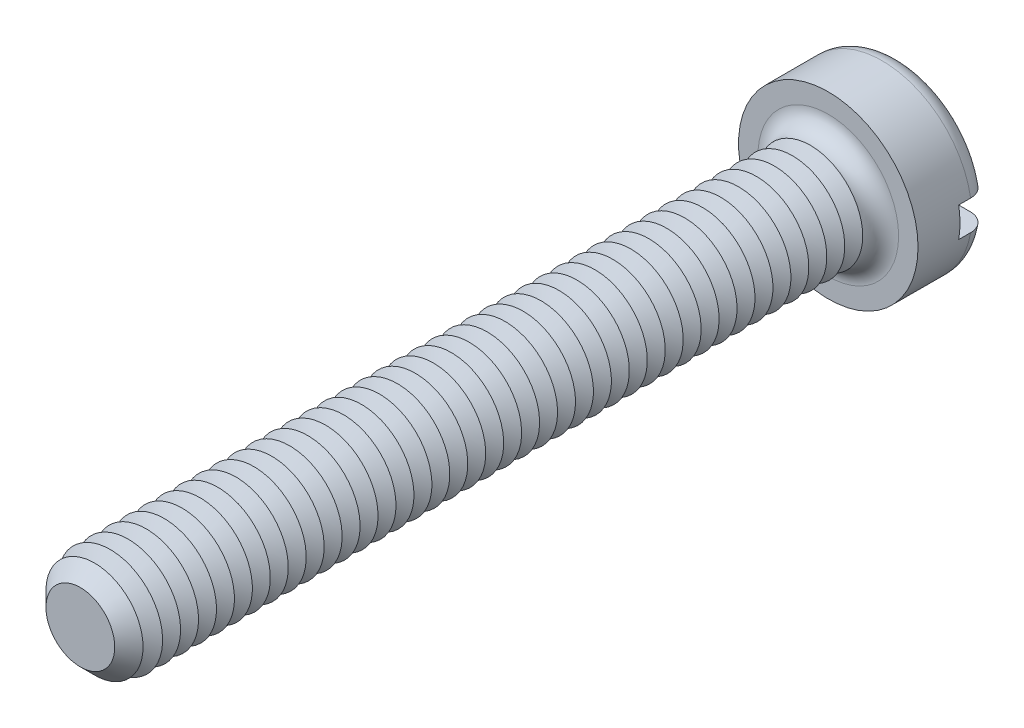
ISO-10303-21;
HEADER;
FILE_DESCRIPTION(('STEP AP214'),'2;1');
FILE_NAME('part.step','',(''),(''),'','','');
FILE_SCHEMA(('AUTOMOTIVE_DESIGN { 1 0 10303 214 1 1 1 1 }'));
ENDSEC;
DATA;
#1=APPLICATION_CONTEXT('core data for automotive mechanical design processes');
#2=APPLICATION_PROTOCOL_DEFINITION('international standard','automotive_design',2000,#1);
#3=PRODUCT_CONTEXT('',#1,'mechanical');
#4=PRODUCT('Part','Part','',(#3));
#5=PRODUCT_RELATED_PRODUCT_CATEGORY('part','',(#4));
#6=PRODUCT_DEFINITION_FORMATION('','',#4);
#7=PRODUCT_DEFINITION_CONTEXT('part definition',#1,'design');
#8=PRODUCT_DEFINITION('design','',#6,#7);
#9=PRODUCT_DEFINITION_SHAPE('','',#8);
#10=(LENGTH_UNIT() NAMED_UNIT(*) SI_UNIT(.MILLI.,.METRE.));
#11=(NAMED_UNIT(*) PLANE_ANGLE_UNIT() SI_UNIT($,.RADIAN.));
#12=(NAMED_UNIT(*) SI_UNIT($,.STERADIAN.) SOLID_ANGLE_UNIT());
#13=UNCERTAINTY_MEASURE_WITH_UNIT(LENGTH_MEASURE(1.E-05),#10,'distance_accuracy_value','');
#14=(GEOMETRIC_REPRESENTATION_CONTEXT(3) GLOBAL_UNCERTAINTY_ASSIGNED_CONTEXT((#13)) GLOBAL_UNIT_ASSIGNED_CONTEXT((#10,
#11,#12)) REPRESENTATION_CONTEXT('',''));
#15=CARTESIAN_POINT('',(0.,0.,0.));
#16=DIRECTION('',(0.,0.,1.));
#17=DIRECTION('',(1.,0.,0.));
#18=AXIS2_PLACEMENT_3D('',#15,#16,#17);
#19=CARTESIAN_POINT('',(0.,0.,-2.4));
#20=DIRECTION('',(0.,0.,1.));
#21=DIRECTION('',(1.,0.,0.));
#22=AXIS2_PLACEMENT_3D('',#19,#20,#21);
#23=PLANE('',#22);
#24=CARTESIAN_POINT('',(0.,0.,-2.4));
#25=DIRECTION('',(0.,0.,1.));
#26=DIRECTION('',(1.,0.,0.));
#27=AXIS2_PLACEMENT_3D('',#24,#25,#26);
#28=CIRCLE('',#27,2.4);
#29=CARTESIAN_POINT('',(-2.3473389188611,0.5,-2.4));
#30=VERTEX_POINT('',#29);
#31=CARTESIAN_POINT('',(2.3473389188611,0.5,-2.4));
#32=VERTEX_POINT('',#31);
#33=EDGE_CURVE('E116',#30,#32,#28,.F.);
#34=ORIENTED_EDGE('',*,*,#33,.T.);
#35=DIRECTION('',(1.,0.,0.));
#36=VECTOR('',#35,1.);
#37=CARTESIAN_POINT('',(-3.,0.5,-2.4));
#38=LINE('',#37,#36);
#39=EDGE_CURVE('E111',#30,#32,#38,.T.);
#40=ORIENTED_EDGE('',*,*,#39,.F.);
#41=EDGE_LOOP('',(#34,#40));
#42=FACE_BOUND('',#41,.T.);
#43=ADVANCED_FACE('F39',(#42),#23,.F.);
#44=CARTESIAN_POINT('',(0.,0.,-1.8));
#45=DIRECTION('',(0.,0.,1.));
#46=DIRECTION('',(1.,0.,0.));
#47=AXIS2_PLACEMENT_3D('',#44,#45,#46);
#48=TOROIDAL_SURFACE('',#47,2.4,0.6);
#49=CARTESIAN_POINT('',(-2.85761641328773,0.5,-2.13010535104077));
#50=CARTESIAN_POINT('',(-2.83871556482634,0.5,-2.1583605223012));
#51=CARTESIAN_POINT('',(-2.81738546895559,0.5,-2.18502342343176));
#52=CARTESIAN_POINT('',(-2.7705148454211,0.5,-2.23439244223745));
#53=CARTESIAN_POINT('',(-2.74496859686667,0.5,-2.25709309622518));
#54=CARTESIAN_POINT('',(-2.6904684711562,0.5,-2.29787524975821));
#55=CARTESIAN_POINT('',(-2.66151863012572,0.5,-2.3159621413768));
#56=CARTESIAN_POINT('',(-2.60103287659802,0.5,-2.34708203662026));
#57=CARTESIAN_POINT('',(-2.56949759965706,0.5,-2.36011627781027));
#58=CARTESIAN_POINT('',(-2.50430694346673,0.5,-2.38095952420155));
#59=CARTESIAN_POINT('',(-2.47062984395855,0.5,-2.38870056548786));
#60=CARTESIAN_POINT('',(-2.40245905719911,0.5,-2.39852415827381));
#61=CARTESIAN_POINT('',(-2.36796525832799,0.5,-2.40060593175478));
#62=CARTESIAN_POINT('',(-2.29850850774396,0.5,-2.39907718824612));
#63=CARTESIAN_POINT('',(-2.2635477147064,0.5,-2.3953679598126));
#64=CARTESIAN_POINT('',(-2.19472542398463,0.5,-2.38219781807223));
#65=CARTESIAN_POINT('',(-2.16086402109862,0.5,-2.37273641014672));
#66=CARTESIAN_POINT('',(-2.09483473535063,0.5,-2.3481926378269));
#67=CARTESIAN_POINT('',(-2.06268841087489,0.5,-2.3330521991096));
#68=CARTESIAN_POINT('',(-2.00140871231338,0.5,-2.29756210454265));
#69=CARTESIAN_POINT('',(-1.97227539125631,0.5,-2.27721235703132));
#70=CARTESIAN_POINT('',(-1.91805676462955,0.5,-2.23196210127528));
#71=CARTESIAN_POINT('',(-1.89294995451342,0.5,-2.20708739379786));
#72=CARTESIAN_POINT('',(-1.84740424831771,0.5,-2.1533758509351));
#73=CARTESIAN_POINT('',(-1.82696468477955,0.5,-2.12453958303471));
#74=CARTESIAN_POINT('',(-1.7919439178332,0.5,-2.06452274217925));
#75=CARTESIAN_POINT('',(-1.7772221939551,0.5,-2.03342424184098));
#76=CARTESIAN_POINT('',(-1.75343025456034,0.5,-1.96913621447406));
#77=CARTESIAN_POINT('',(-1.74435859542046,0.5,-1.93594722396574));
#78=CARTESIAN_POINT('',(-1.73243855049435,0.5,-1.86969199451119));
#79=CARTESIAN_POINT('',(-1.72938008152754,0.5,-1.83666346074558));
#80=CARTESIAN_POINT('',(-1.72896592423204,0.5,-1.77057287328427));
#81=CARTESIAN_POINT('',(-1.73160950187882,0.5,-1.73751082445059));
#82=CARTESIAN_POINT('',(-1.7423966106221,0.5,-1.67291835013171));
#83=CARTESIAN_POINT('',(-1.75043952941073,0.5,-1.64137102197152));
#84=CARTESIAN_POINT('',(-1.77163396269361,0.5,-1.58004446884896));
#85=CARTESIAN_POINT('',(-1.78478577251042,0.5,-1.55026534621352));
#86=CARTESIAN_POINT('',(-1.81598186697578,0.5,-1.49283859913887));
#87=CARTESIAN_POINT('',(-1.83409369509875,0.5,-1.46522772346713));
#88=CARTESIAN_POINT('',(-1.87455179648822,0.5,-1.41330756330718));
#89=CARTESIAN_POINT('',(-1.89689874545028,0.5,-1.38899880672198));
#90=CARTESIAN_POINT('',(-1.94600584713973,0.5,-1.34349499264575));
#91=CARTESIAN_POINT('',(-1.97289034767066,0.5,-1.32243411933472));
#92=CARTESIAN_POINT('',(-2.02972905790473,0.5,-1.28496935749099));
#93=CARTESIAN_POINT('',(-2.05968375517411,0.5,-1.26856621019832));
#94=CARTESIAN_POINT('',(-2.12276894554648,0.5,-1.24040709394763));
#95=CARTESIAN_POINT('',(-2.15596700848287,0.5,-1.22880230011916));
#96=CARTESIAN_POINT('',(-2.22383000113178,0.5,-1.21126311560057));
#97=CARTESIAN_POINT('',(-2.25849504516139,0.5,-1.20532916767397));
#98=CARTESIAN_POINT('',(-2.32870403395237,0.5,-1.1992792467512));
#99=CARTESIAN_POINT('',(-2.36425340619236,0.5,-1.19922586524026));
#100=CARTESIAN_POINT('',(-2.4348506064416,0.5,-1.2051326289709));
#101=CARTESIAN_POINT('',(-2.4698984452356,0.5,-1.21109264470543));
#102=CARTESIAN_POINT('',(-2.53821803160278,0.5,-1.22883658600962));
#103=CARTESIAN_POINT('',(-2.57150081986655,0.5,-1.24057794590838));
#104=CARTESIAN_POINT('',(-2.63557260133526,0.5,-1.2695744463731));
#105=CARTESIAN_POINT('',(-2.66636179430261,0.5,-1.28682914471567));
#106=CARTESIAN_POINT('',(-2.72402406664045,0.5,-1.32606063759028));
#107=CARTESIAN_POINT('',(-2.75095352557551,0.5,-1.34795455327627));
#108=CARTESIAN_POINT('',(-2.80067182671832,0.5,-1.39602603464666));
#109=CARTESIAN_POINT('',(-2.82346106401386,0.5,-1.42220319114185));
#110=CARTESIAN_POINT('',(-2.86383281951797,0.5,-1.47760238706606));
#111=CARTESIAN_POINT('',(-2.88149947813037,0.5,-1.50676312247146));
#112=CARTESIAN_POINT('',(-2.91160874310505,0.5,-1.56766595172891));
#113=CARTESIAN_POINT('',(-2.92405198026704,0.5,-1.59940773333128));
#114=CARTESIAN_POINT('',(-2.94319943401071,0.5,-1.66411282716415));
#115=CARTESIAN_POINT('',(-2.94997843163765,0.5,-1.69705402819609));
#116=CARTESIAN_POINT('',(-2.95787009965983,0.5,-1.7636173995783));
#117=CARTESIAN_POINT('',(-2.95898157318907,0.5,-1.79723971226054));
#118=CARTESIAN_POINT('',(-2.95551354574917,0.5,-1.86397776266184));
#119=CARTESIAN_POINT('',(-2.95096897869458,0.5,-1.89709534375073));
#120=CARTESIAN_POINT('',(-2.93638731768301,0.5,-1.96206785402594));
#121=CARTESIAN_POINT('',(-2.92635713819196,0.5,-1.99392431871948));
#122=CARTESIAN_POINT('',(-2.90618743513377,0.5,-2.04315073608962));
#123=CARTESIAN_POINT('',(-2.89769874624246,0.5,-2.06121519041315));
#124=CARTESIAN_POINT('',(-2.87895753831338,0.5,-2.096404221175));
#125=CARTESIAN_POINT('',(-2.86870503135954,0.5,-2.11352880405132));
#126=CARTESIAN_POINT('',(-2.85761641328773,0.5,-2.13010535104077));
#127=B_SPLINE_CURVE_WITH_KNOTS('',3,(#49,#50,#51,#52,#53,#54,#55,#56,#57,#58,#59,#60,#61,#62,
#63,#64,#65,#66,#67,#68,#69,#70,#71,#72,#73,#74,#75,#76,#77,#78,#79,#80,#81,#82,#83,#84,#85,#86,
#87,#88,#89,#90,#91,#92,#93,#94,#95,#96,#97,#98,#99,#100,#101,#102,#103,#104,#105,#106,#107,
#108,#109,#110,#111,#112,#113,#114,#115,#116,#117,#118,#119,#120,#121,#122,#123,#124,#125,#126),
.UNSPECIFIED.,.T.,.F.,(4,2,2,2,2,2,2,2,2,2,2,2,2,2,2,2,2,2,2,2,2,2,2,2,2,2,2,2,2,2,2,2,2,2,2,2,
2,2,4),(0.,0.101907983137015,0.203955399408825,0.305883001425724,0.407785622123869,
0.510973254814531,0.614175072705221,0.719155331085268,0.824144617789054,0.930238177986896,
1.03633360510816,1.14184204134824,1.24733537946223,1.35004136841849,1.45272110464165,
1.5517448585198,1.65075586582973,1.74797128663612,1.84519232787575,1.9438094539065,
2.0424423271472,2.14443321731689,2.24644032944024,2.35145317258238,2.45647421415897,
2.56261297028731,2.66874944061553,2.77411589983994,2.87947390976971,2.98308820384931,
3.08669260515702,3.18848388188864,3.29026286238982,3.39067588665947,3.49111011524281,
3.59092708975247,3.69061853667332,3.75040561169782,3.81019227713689),.UNSPECIFIED.);
#128=CARTESIAN_POINT('',(-2.95803989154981,0.5,-1.8));
#129=VERTEX_POINT('',#128);
#130=EDGE_CURVE('E505',#129,#30,#127,.T.);
#131=ORIENTED_EDGE('',*,*,#130,.F.);
#132=CARTESIAN_POINT('',(0.,0.,-1.8));
#133=DIRECTION('',(0.,0.,1.));
#134=DIRECTION('',(1.,0.,0.));
#135=AXIS2_PLACEMENT_3D('',#132,#133,#134);
#136=CIRCLE('',#135,3.);
#137=CARTESIAN_POINT('',(2.95803989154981,0.5,-1.8));
#138=VERTEX_POINT('',#137);
#139=EDGE_CURVE('E125',#138,#129,#136,.T.);
#140=ORIENTED_EDGE('',*,*,#139,.F.);
#141=CARTESIAN_POINT('',(1.78664846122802,0.5,-2.05158390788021));
#142=CARTESIAN_POINT('',(1.80142751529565,0.5,-2.08239430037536));
#143=CARTESIAN_POINT('',(1.81889355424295,0.5,-2.111949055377));
#144=CARTESIAN_POINT('',(1.8585933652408,0.5,-2.16770384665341));
#145=CARTESIAN_POINT('',(1.88083491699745,0.5,-2.19389829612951));
#146=CARTESIAN_POINT('',(1.92931942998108,0.5,-2.24217519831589));
#147=CARTESIAN_POINT('',(1.95555471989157,0.5,-2.26426535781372));
#148=CARTESIAN_POINT('',(2.01127789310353,0.5,-2.30384045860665));
#149=CARTESIAN_POINT('',(2.04076488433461,0.5,-2.32132665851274));
#150=CARTESIAN_POINT('',(2.10290022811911,0.5,-2.3516259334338));
#151=CARTESIAN_POINT('',(2.13560600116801,0.5,-2.3643213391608));
#152=CARTESIAN_POINT('',(2.20267136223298,0.5,-2.38412242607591));
#153=CARTESIAN_POINT('',(2.23703118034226,0.5,-2.3912273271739));
#154=CARTESIAN_POINT('',(2.30690186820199,0.5,-2.39969404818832));
#155=CARTESIAN_POINT('',(2.34242185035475,0.5,-2.40098100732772));
#156=CARTESIAN_POINT('',(2.41317063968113,0.5,-2.39753827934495));
#157=CARTESIAN_POINT('',(2.44839945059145,0.5,-2.39280866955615));
#158=CARTESIAN_POINT('',(2.51734146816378,0.5,-2.37746773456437));
#159=CARTESIAN_POINT('',(2.55106223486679,0.5,-2.3668904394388));
#160=CARTESIAN_POINT('',(2.61620389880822,0.5,-2.34013333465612));
#161=CARTESIAN_POINT('',(2.64762498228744,0.5,-2.32395397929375));
#162=CARTESIAN_POINT('',(2.70673284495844,0.5,-2.28672393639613));
#163=CARTESIAN_POINT('',(2.73447138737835,0.5,-2.26575544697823));
#164=CARTESIAN_POINT('',(2.78595339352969,0.5,-2.21938197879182));
#165=CARTESIAN_POINT('',(2.80969724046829,0.5,-2.19397742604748));
#166=CARTESIAN_POINT('',(2.85207235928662,0.5,-2.13993965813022));
#167=CARTESIAN_POINT('',(2.87078674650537,0.5,-2.11137160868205));
#168=CARTESIAN_POINT('',(2.90307455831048,0.5,-2.05146448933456));
#169=CARTESIAN_POINT('',(2.91664841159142,0.5,-2.02012565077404));
#170=CARTESIAN_POINT('',(2.93808283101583,0.5,-1.95603682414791));
#171=CARTESIAN_POINT('',(2.94602016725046,0.5,-1.92331249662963));
#172=CARTESIAN_POINT('',(2.95624273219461,0.5,-1.85699296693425));
#173=CARTESIAN_POINT('',(2.95852824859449,0.5,-1.82339780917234));
#174=CARTESIAN_POINT('',(2.95738171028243,0.5,-1.75655451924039));
#175=CARTESIAN_POINT('',(2.95399174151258,0.5,-1.72330565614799));
#176=CARTESIAN_POINT('',(2.94167749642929,0.5,-1.65784996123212));
#177=CARTESIAN_POINT('',(2.93275329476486,0.5,-1.62564311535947));
#178=CARTESIAN_POINT('',(2.90963870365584,0.5,-1.56317641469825));
#179=CARTESIAN_POINT('',(2.89544787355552,0.5,-1.53291672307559));
#180=CARTESIAN_POINT('',(2.86222325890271,0.5,-1.47518589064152));
#181=CARTESIAN_POINT('',(2.84318935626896,0.5,-1.44771481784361));
#182=CARTESIAN_POINT('',(2.80067851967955,0.5,-1.39611362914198));
#183=CARTESIAN_POINT('',(2.77716960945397,0.5,-1.37200986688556));
#184=CARTESIAN_POINT('',(2.72648704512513,0.5,-1.3280274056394));
#185=CARTESIAN_POINT('',(2.69931317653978,0.5,-1.3081489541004));
#186=CARTESIAN_POINT('',(2.64167967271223,0.5,-1.27288334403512));
#187=CARTESIAN_POINT('',(2.61118015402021,0.5,-1.25756138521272));
#188=CARTESIAN_POINT('',(2.54807315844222,0.5,-1.2321564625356));
#189=CARTESIAN_POINT('',(2.51546550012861,0.5,-1.22207395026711));
#190=CARTESIAN_POINT('',(2.44846246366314,0.5,-1.20724783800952));
#191=CARTESIAN_POINT('',(2.41404584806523,0.5,-1.2026002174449));
#192=CARTESIAN_POINT('',(2.34491756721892,0.5,-1.19904907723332));
#193=CARTESIAN_POINT('',(2.3102058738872,0.5,-1.20014611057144));
#194=CARTESIAN_POINT('',(2.24087507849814,0.5,-1.20808958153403));
#195=CARTESIAN_POINT('',(2.20626660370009,0.5,-1.21502895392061));
#196=CARTESIAN_POINT('',(2.13868705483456,0.5,-1.23457616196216));
#197=CARTESIAN_POINT('',(2.10571611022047,0.5,-1.24718444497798));
#198=CARTESIAN_POINT('',(2.04212010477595,0.5,-1.2778419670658));
#199=CARTESIAN_POINT('',(2.0115131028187,0.5,-1.29592871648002));
#200=CARTESIAN_POINT('',(1.95381117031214,0.5,-1.33703838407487));
#201=CARTESIAN_POINT('',(1.92671618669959,0.5,-1.36006122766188));
#202=CARTESIAN_POINT('',(1.8771749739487,0.5,-1.41014760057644));
#203=CARTESIAN_POINT('',(1.85467966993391,0.5,-1.43716252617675));
#204=CARTESIAN_POINT('',(1.8147167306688,0.5,-1.49468601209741));
#205=CARTESIAN_POINT('',(1.79724791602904,0.5,-1.52519375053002));
#206=CARTESIAN_POINT('',(1.76843420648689,0.5,-1.58782676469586));
#207=CARTESIAN_POINT('',(1.75691546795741,0.5,-1.61987202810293));
#208=CARTESIAN_POINT('',(1.73963101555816,0.5,-1.68548715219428));
#209=CARTESIAN_POINT('',(1.73386545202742,0.5,-1.71905705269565));
#210=CARTESIAN_POINT('',(1.72840927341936,0.5,-1.78556262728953));
#211=CARTESIAN_POINT('',(1.72852416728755,0.5,-1.8184825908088));
#212=CARTESIAN_POINT('',(1.73434422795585,0.5,-1.88379362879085));
#213=CARTESIAN_POINT('',(1.74004181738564,0.5,-1.91618535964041));
#214=CARTESIAN_POINT('',(1.75312909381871,0.5,-1.96568884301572));
#215=CARTESIAN_POINT('',(1.75869685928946,0.5,-1.98330302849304));
#216=CARTESIAN_POINT('',(1.77146455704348,0.5,-2.01792824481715));
#217=CARTESIAN_POINT('',(1.7786644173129,0.5,-2.03493930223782));
#218=CARTESIAN_POINT('',(1.78664846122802,0.5,-2.05158390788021));
#219=B_SPLINE_CURVE_WITH_KNOTS('',3,(#141,#142,#143,#144,#145,#146,#147,#148,#149,#150,#151,
#152,#153,#154,#155,#156,#157,#158,#159,#160,#161,#162,#163,#164,#165,#166,#167,#168,#169,#170,
#171,#172,#173,#174,#175,#176,#177,#178,#179,#180,#181,#182,#183,#184,#185,#186,#187,#188,#189,
#190,#191,#192,#193,#194,#195,#196,#197,#198,#199,#200,#201,#202,#203,#204,#205,#206,#207,#208,
#209,#210,#211,#212,#213,#214,#215,#216,#217,#218),.UNSPECIFIED.,.T.,.F.,(4,2,2,2,2,2,2,2,2,2,2,
2,2,2,2,2,2,2,2,2,2,2,2,2,2,2,2,2,2,2,2,2,2,2,2,2,2,2,4),(0.,0.10244464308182,0.205057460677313,
0.307475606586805,0.409865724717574,0.514628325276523,0.619405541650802,0.72552718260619,
0.831647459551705,0.937156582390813,1.04265715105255,1.1464674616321,1.25026780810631,
1.3522293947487,1.45418247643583,1.55471883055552,1.6552500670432,1.75503912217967,
1.8548268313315,1.95462289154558,2.05442138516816,2.15496174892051,2.25550799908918,
2.35743049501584,2.45936177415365,2.56306719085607,2.66678259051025,2.77217967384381,
2.87758507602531,2.98372914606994,3.08987161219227,3.19481457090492,3.29973288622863,
3.40138228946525,3.50303434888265,3.60132659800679,3.69948562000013,3.75483142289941,
3.8101747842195),.UNSPECIFIED.);
#220=EDGE_CURVE('E507',#32,#138,#219,.T.);
#221=ORIENTED_EDGE('',*,*,#220,.F.);
#222=ORIENTED_EDGE('',*,*,#33,.F.);
#223=EDGE_LOOP('',(#131,#140,#221,#222));
#224=FACE_BOUND('',#223,.T.);
#225=ADVANCED_FACE('F489',(#224),#48,.T.);
#226=CARTESIAN_POINT('',(0.,0.,-2.4));
#227=DIRECTION('',(0.,0.,1.));
#228=DIRECTION('',(1.,0.,0.));
#229=AXIS2_PLACEMENT_3D('',#226,#227,#228);
#230=CYLINDRICAL_SURFACE('',#229,3.);
#231=DIRECTION('',(0.,0.,1.));
#232=VECTOR('',#231,1.);
#233=CARTESIAN_POINT('',(2.95803989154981,0.5,-2.4));
#234=LINE('',#233,#232);
#235=CARTESIAN_POINT('',(2.95803989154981,0.5,-1.4));
#236=VERTEX_POINT('',#235);
#237=EDGE_CURVE('E522',#138,#236,#234,.T.);
#238=ORIENTED_EDGE('',*,*,#237,.F.);
#239=ORIENTED_EDGE('',*,*,#139,.T.);
#240=DIRECTION('',(0.,0.,1.));
#241=VECTOR('',#240,1.);
#242=CARTESIAN_POINT('',(-2.95803989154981,0.5,-2.4));
#243=LINE('',#242,#241);
#244=CARTESIAN_POINT('',(-2.95803989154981,0.5,-1.4));
#245=VERTEX_POINT('',#244);
#246=EDGE_CURVE('E63',#245,#129,#243,.F.);
#247=ORIENTED_EDGE('',*,*,#246,.F.);
#248=CARTESIAN_POINT('',(0.,0.,-1.4));
#249=DIRECTION('',(0.,0.,-1.));
#250=DIRECTION('',(-1.,0.,0.));
#251=AXIS2_PLACEMENT_3D('',#248,#249,#250);
#252=CIRCLE('',#251,3.);
#253=CARTESIAN_POINT('',(-2.95803989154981,-0.5,-1.4));
#254=VERTEX_POINT('',#253);
#255=EDGE_CURVE('E43',#245,#254,#252,.F.);
#256=ORIENTED_EDGE('',*,*,#255,.T.);
#257=DIRECTION('',(0.,0.,1.));
#258=VECTOR('',#257,1.);
#259=CARTESIAN_POINT('',(-2.95803989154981,-0.5,-2.4));
#260=LINE('',#259,#258);
#261=CARTESIAN_POINT('',(-2.9580398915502,-0.5,-1.79999999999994));
#262=VERTEX_POINT('',#261);
#263=EDGE_CURVE('E519',#262,#254,#260,.T.);
#264=ORIENTED_EDGE('',*,*,#263,.F.);
#265=CARTESIAN_POINT('',(2.95803989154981,-0.5,-1.8));
#266=VERTEX_POINT('',#265);
#267=EDGE_CURVE('E127',#262,#266,#136,.T.);
#268=ORIENTED_EDGE('',*,*,#267,.T.);
#269=DIRECTION('',(0.,0.,1.));
#270=VECTOR('',#269,1.);
#271=CARTESIAN_POINT('',(2.95803989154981,-0.5,-2.4));
#272=LINE('',#271,#270);
#273=CARTESIAN_POINT('',(2.95803989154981,-0.5,-1.4));
#274=VERTEX_POINT('',#273);
#275=EDGE_CURVE('E55',#274,#266,#272,.F.);
#276=ORIENTED_EDGE('',*,*,#275,.F.);
#277=EDGE_CURVE('E11',#274,#236,#252,.F.);
#278=ORIENTED_EDGE('',*,*,#277,.T.);
#279=EDGE_LOOP('',(#238,#239,#247,#256,#264,#268,#276,#278));
#280=FACE_BOUND('',#279,.T.);
#281=CARTESIAN_POINT('',(0.,0.,0.));
#282=DIRECTION('',(0.,0.,1.));
#283=DIRECTION('',(1.,0.,0.));
#284=AXIS2_PLACEMENT_3D('',#281,#282,#283);
#285=CIRCLE('',#284,3.);
#286=CARTESIAN_POINT('',(3.,0.,0.));
#287=VERTEX_POINT('',#286);
#288=EDGE_CURVE('E524',#287,#287,#285,.T.);
#289=ORIENTED_EDGE('',*,*,#288,.F.);
#290=EDGE_LOOP('',(#289));
#291=FACE_BOUND('',#290,.T.);
#292=ADVANCED_FACE('F485',(#280,#291),#230,.T.);
#293=CARTESIAN_POINT('',(2.3473389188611,-0.5,-2.4));
#294=VERTEX_POINT('',#293);
#295=CARTESIAN_POINT('',(-2.3473389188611,-0.5,-2.4));
#296=VERTEX_POINT('',#295);
#297=EDGE_CURVE('E109',#294,#296,#28,.F.);
#298=ORIENTED_EDGE('',*,*,#297,.T.);
#299=DIRECTION('',(-1.,0.,0.));
#300=VECTOR('',#299,1.);
#301=CARTESIAN_POINT('',(-3.,-0.5,-2.4));
#302=LINE('',#301,#300);
#303=EDGE_CURVE('E96',#294,#296,#302,.T.);
#304=ORIENTED_EDGE('',*,*,#303,.F.);
#305=EDGE_LOOP('',(#298,#304));
#306=FACE_BOUND('',#305,.T.);
#307=ADVANCED_FACE('F108',(#306),#23,.F.);
#308=CARTESIAN_POINT('',(0.,0.,0.));
#309=DIRECTION('',(0.,0.,1.));
#310=DIRECTION('',(1.,0.,0.));
#311=AXIS2_PLACEMENT_3D('',#308,#309,#310);
#312=PLANE('',#311);
#313=CARTESIAN_POINT('',(0.,0.,0.));
#314=DIRECTION('',(0.,0.,1.));
#315=DIRECTION('',(1.,0.,0.));
#316=AXIS2_PLACEMENT_3D('',#313,#314,#315);
#317=CIRCLE('',#316,2.35);
#318=CARTESIAN_POINT('',(2.35,0.,0.));
#319=VERTEX_POINT('',#318);
#320=EDGE_CURVE('E115',#319,#319,#317,.F.);
#321=ORIENTED_EDGE('',*,*,#320,.T.);
#322=EDGE_LOOP('',(#321));
#323=FACE_BOUND('',#322,.T.);
#324=ORIENTED_EDGE('',*,*,#288,.T.);
#325=EDGE_LOOP('',(#324));
#326=FACE_BOUND('',#325,.T.);
#327=ADVANCED_FACE('F484',(#323,#326),#312,.T.);
#328=CARTESIAN_POINT('',(-2.85761641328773,-0.5,-2.13010535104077));
#329=CARTESIAN_POINT('',(-2.87617085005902,-0.5,-2.10236255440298));
#330=CARTESIAN_POINT('',(-2.89241094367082,-0.5,-2.07304478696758));
#331=CARTESIAN_POINT('',(-2.91975805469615,-0.5,-2.01207835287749));
#332=CARTESIAN_POINT('',(-2.93085958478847,-0.5,-1.98042723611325));
#333=CARTESIAN_POINT('',(-2.94757590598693,-0.5,-1.91570997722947));
#334=CARTESIAN_POINT('',(-2.95319165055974,-0.5,-1.88264408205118));
#335=CARTESIAN_POINT('',(-2.95876526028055,-0.5,-1.81604673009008));
#336=CARTESIAN_POINT('',(-2.95872441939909,-0.5,-1.78251538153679));
#337=CARTESIAN_POINT('',(-2.95300126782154,-0.5,-1.71606888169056));
#338=CARTESIAN_POINT('',(-2.94734076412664,-0.5,-1.68315184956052));
#339=CARTESIAN_POINT('',(-2.93058183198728,-0.5,-1.61873244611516));
#340=CARTESIAN_POINT('',(-2.91948325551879,-0.5,-1.58723011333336));
#341=CARTESIAN_POINT('',(-2.89215903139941,-0.5,-1.52647404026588));
#342=CARTESIAN_POINT('',(-2.87592518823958,-0.5,-1.49722398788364));
#343=CARTESIAN_POINT('',(-2.83881787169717,-0.5,-1.44183365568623));
#344=CARTESIAN_POINT('',(-2.81794425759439,-0.5,-1.41569347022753));
#345=CARTESIAN_POINT('',(-2.77196258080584,-0.5,-1.36700890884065));
#346=CARTESIAN_POINT('',(-2.74681874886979,-0.5,-1.34449832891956));
#347=CARTESIAN_POINT('',(-2.69315595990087,-0.5,-1.30394571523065));
#348=CARTESIAN_POINT('',(-2.66463678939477,-0.5,-1.28590396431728));
#349=CARTESIAN_POINT('',(-2.6045885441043,-0.5,-1.25451133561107));
#350=CARTESIAN_POINT('',(-2.573021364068,-0.5,-1.24123336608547));
#351=CARTESIAN_POINT('',(-2.50813094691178,-0.5,-1.22006271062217));
#352=CARTESIAN_POINT('',(-2.47480755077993,-0.5,-1.21217051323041));
#353=CARTESIAN_POINT('',(-2.40672281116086,-0.5,-1.20185046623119));
#354=CARTESIAN_POINT('',(-2.37194646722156,-0.5,-1.19952155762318));
#355=CARTESIAN_POINT('',(-2.30248663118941,-0.5,-1.20064178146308));
#356=CARTESIAN_POINT('',(-2.26780314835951,-0.5,-1.20409147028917));
#357=CARTESIAN_POINT('',(-2.19896003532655,-0.5,-1.21674803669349));
#358=CARTESIAN_POINT('',(-2.16481620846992,-0.5,-1.22604100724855));
#359=CARTESIAN_POINT('',(-2.09855902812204,-0.5,-1.25020237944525));
#360=CARTESIAN_POINT('',(-2.0664458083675,-0.5,-1.2650711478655));
#361=CARTESIAN_POINT('',(-2.00504979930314,-0.5,-1.3000633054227));
#362=CARTESIAN_POINT('',(-1.97577870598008,-0.5,-1.32020724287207));
#363=CARTESIAN_POINT('',(-1.92109882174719,-0.5,-1.36519538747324));
#364=CARTESIAN_POINT('',(-1.89568984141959,-0.5,-1.39003936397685));
#365=CARTESIAN_POINT('',(-1.84992350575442,-0.5,-1.44333696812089));
#366=CARTESIAN_POINT('',(-1.82949305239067,-0.5,-1.47172774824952));
#367=CARTESIAN_POINT('',(-1.79388305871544,-0.5,-1.53163225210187));
#368=CARTESIAN_POINT('',(-1.77870235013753,-0.5,-1.56314527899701));
#369=CARTESIAN_POINT('',(-1.7545759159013,-0.5,-1.62726698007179));
#370=CARTESIAN_POINT('',(-1.74543784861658,-0.5,-1.65980327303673));
#371=CARTESIAN_POINT('',(-1.73294830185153,-0.5,-1.72596654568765));
#372=CARTESIAN_POINT('',(-1.72959555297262,-0.5,-1.7595932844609));
#373=CARTESIAN_POINT('',(-1.72881879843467,-0.5,-1.82588200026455));
#374=CARTESIAN_POINT('',(-1.73121660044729,-0.5,-1.85854202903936));
#375=CARTESIAN_POINT('',(-1.74148022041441,-0.5,-1.9229888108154));
#376=CARTESIAN_POINT('',(-1.74934586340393,-0.5,-1.95477559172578));
#377=CARTESIAN_POINT('',(-1.77023164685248,-0.5,-2.01650910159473));
#378=CARTESIAN_POINT('',(-1.78323812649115,-0.5,-2.04646046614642));
#379=CARTESIAN_POINT('',(-1.81396733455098,-0.5,-2.10383471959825));
#380=CARTESIAN_POINT('',(-1.83169061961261,-0.5,-2.13125730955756));
#381=CARTESIAN_POINT('',(-1.87183626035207,-0.5,-2.18359240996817));
#382=CARTESIAN_POINT('',(-1.89437158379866,-0.5,-2.20841820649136));
#383=CARTESIAN_POINT('',(-1.9431646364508,-0.5,-2.25409214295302));
#384=CARTESIAN_POINT('',(-1.96942301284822,-0.5,-2.27493958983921));
#385=CARTESIAN_POINT('',(-2.025898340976,-0.5,-2.31281042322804));
#386=CARTESIAN_POINT('',(-2.05622082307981,-0.5,-2.32967654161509));
#387=CARTESIAN_POINT('',(-2.11922391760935,-0.5,-2.35820255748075));
#388=CARTESIAN_POINT('',(-2.15190483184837,-0.5,-2.3698617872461));
#389=CARTESIAN_POINT('',(-2.21944675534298,-0.5,-2.38785911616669));
#390=CARTESIAN_POINT('',(-2.25433929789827,-0.5,-2.39407914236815));
#391=CARTESIAN_POINT('',(-2.32467357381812,-0.5,-2.40058243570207));
#392=CARTESIAN_POINT('',(-2.36011530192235,-0.5,-2.40086575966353));
#393=CARTESIAN_POINT('',(-2.43058129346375,-0.5,-2.39545061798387));
#394=CARTESIAN_POINT('',(-2.46560504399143,-0.5,-2.38974544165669));
#395=CARTESIAN_POINT('',(-2.53418188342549,-0.5,-2.37245602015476));
#396=CARTESIAN_POINT('',(-2.56773468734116,-0.5,-2.36087064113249));
#397=CARTESIAN_POINT('',(-2.63195003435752,-0.5,-2.33229154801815));
#398=CARTESIAN_POINT('',(-2.66264330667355,-0.5,-2.31536681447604));
#399=CARTESIAN_POINT('',(-2.72065333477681,-0.5,-2.2765252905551));
#400=CARTESIAN_POINT('',(-2.7479744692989,-0.5,-2.25461508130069));
#401=CARTESIAN_POINT('',(-2.78903570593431,-0.5,-2.21539504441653));
#402=CARTESIAN_POINT('',(-2.80405150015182,-0.5,-2.19939833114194));
#403=CARTESIAN_POINT('',(-2.83224965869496,-0.5,-2.16586257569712));
#404=CARTESIAN_POINT('',(-2.84543204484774,-0.5,-2.14832355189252));
#405=CARTESIAN_POINT('',(-2.85761641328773,-0.5,-2.13010535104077));
#406=B_SPLINE_CURVE_WITH_KNOTS('',3,(#328,#329,#330,#331,#332,#333,#334,#335,#336,#337,#338,
#339,#340,#341,#342,#343,#344,#345,#346,#347,#348,#349,#350,#351,#352,#353,#354,#355,#356,#357,
#358,#359,#360,#361,#362,#363,#364,#365,#366,#367,#368,#369,#370,#371,#372,#373,#374,#375,#376,
#377,#378,#379,#380,#381,#382,#383,#384,#385,#386,#387,#388,#389,#390,#391,#392,#393,#394,#395,
#396,#397,#398,#399,#400,#401,#402,#403,#404,#405),.UNSPECIFIED.,.T.,.F.,(4,2,2,2,2,2,2,2,2,2,2,
2,2,2,2,2,2,2,2,2,2,2,2,2,2,2,2,2,2,2,2,2,2,2,2,2,2,2,4),(0.,0.100047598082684,
0.200201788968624,0.300338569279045,0.400452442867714,0.500179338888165,0.599908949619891,
0.699798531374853,0.799691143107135,0.900465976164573,1.00124718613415,1.10351091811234,
1.20578392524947,1.30986270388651,1.41395150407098,1.51961105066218,1.62527754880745,
1.73136193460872,1.83744111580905,1.94185359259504,2.04624281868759,2.1471248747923,
2.24798479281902,2.34575994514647,2.44353196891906,2.541045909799,2.63857136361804,
2.73870431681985,2.83885469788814,2.94247024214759,3.0460990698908,3.15192527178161,
3.25775046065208,3.36369436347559,3.46965870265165,3.57430655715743,3.67881706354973,
3.74451732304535,3.81021680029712),.UNSPECIFIED.);
#407=EDGE_CURVE('E103',#296,#262,#406,.T.);
#408=ORIENTED_EDGE('',*,*,#407,.F.);
#409=ORIENTED_EDGE('',*,*,#297,.F.);
#410=CARTESIAN_POINT('',(1.78664846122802,-0.5,-2.05158390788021));
#411=CARTESIAN_POINT('',(1.77253256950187,-0.5,-2.02214917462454));
#412=CARTESIAN_POINT('',(1.76084795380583,-0.5,-1.99152692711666));
#413=CARTESIAN_POINT('',(1.74276267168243,-0.5,-1.92873811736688));
#414=CARTESIAN_POINT('',(1.73636622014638,-0.5,-1.89657034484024));
#415=CARTESIAN_POINT('',(1.72910271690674,-0.5,-1.83160458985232));
#416=CARTESIAN_POINT('',(1.72823699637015,-0.5,-1.79880645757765));
#417=CARTESIAN_POINT('',(1.73207277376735,-0.5,-1.73354460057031));
#418=CARTESIAN_POINT('',(1.7367732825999,-0.5,-1.70108081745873));
#419=CARTESIAN_POINT('',(1.75151033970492,-0.5,-1.63763571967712));
#420=CARTESIAN_POINT('',(1.76150868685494,-0.5,-1.60664550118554));
#421=CARTESIAN_POINT('',(1.78646773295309,-0.5,-1.54673433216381));
#422=CARTESIAN_POINT('',(1.80142897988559,-0.5,-1.51781361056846));
#423=CARTESIAN_POINT('',(1.8361687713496,-0.5,-1.46223275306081));
#424=CARTESIAN_POINT('',(1.85603637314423,-0.5,-1.43562834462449));
#425=CARTESIAN_POINT('',(1.89981598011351,-0.5,-1.38598822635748));
#426=CARTESIAN_POINT('',(1.92372865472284,-0.5,-1.3629531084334));
#427=CARTESIAN_POINT('',(1.97581791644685,-0.5,-1.32025912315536));
#428=CARTESIAN_POINT('',(2.00411431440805,-0.5,-1.30074638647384));
#429=CARTESIAN_POINT('',(2.06351340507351,-0.5,-1.26660223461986));
#430=CARTESIAN_POINT('',(2.09461651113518,-0.5,-1.2519715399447));
#431=CARTESIAN_POINT('',(2.15964055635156,-0.5,-1.22763649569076));
#432=CARTESIAN_POINT('',(2.19361437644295,-0.5,-1.21807321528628));
#433=CARTESIAN_POINT('',(2.26268197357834,-0.5,-1.20474094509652));
#434=CARTESIAN_POINT('',(2.29777581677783,-0.5,-1.20097229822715));
#435=CARTESIAN_POINT('',(2.36834397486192,-0.5,-1.19935270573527));
#436=CARTESIAN_POINT('',(2.40381924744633,-0.5,-1.20154258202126));
#437=CARTESIAN_POINT('',(2.47388621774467,-0.5,-1.211906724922));
#438=CARTESIAN_POINT('',(2.50847794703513,-0.5,-1.22008077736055));
#439=CARTESIAN_POINT('',(2.57542869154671,-0.5,-1.24211740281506));
#440=CARTESIAN_POINT('',(2.60780612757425,-0.5,-1.25592395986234));
#441=CARTESIAN_POINT('',(2.66972487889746,-0.5,-1.28886991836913));
#442=CARTESIAN_POINT('',(2.69926644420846,-0.5,-1.3080088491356));
#443=CARTESIAN_POINT('',(2.75412764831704,-0.5,-1.35072337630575));
#444=CARTESIAN_POINT('',(2.77951140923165,-0.5,-1.37421661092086));
#445=CARTESIAN_POINT('',(2.82588981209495,-0.5,-1.42519687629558));
#446=CARTESIAN_POINT('',(2.84688487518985,-0.5,-1.4526835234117));
#447=CARTESIAN_POINT('',(2.88351678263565,-0.5,-1.51036368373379));
#448=CARTESIAN_POINT('',(2.89923879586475,-0.5,-1.54050312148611));
#449=CARTESIAN_POINT('',(2.92532780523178,-0.5,-1.60301687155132));
#450=CARTESIAN_POINT('',(2.93569520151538,-0.5,-1.63539101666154));
#451=CARTESIAN_POINT('',(2.95066155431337,-0.5,-1.70102985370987));
#452=CARTESIAN_POINT('',(2.95532930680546,-0.5,-1.73427887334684));
#453=CARTESIAN_POINT('',(2.9589838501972,-0.5,-1.80108716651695));
#454=CARTESIAN_POINT('',(2.95797087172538,-0.5,-1.83464642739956));
#455=CARTESIAN_POINT('',(2.9503157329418,-0.5,-1.90093629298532));
#456=CARTESIAN_POINT('',(2.9437032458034,-0.5,-1.93367033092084));
#457=CARTESIAN_POINT('',(2.92508830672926,-0.5,-1.99756717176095));
#458=CARTESIAN_POINT('',(2.91308586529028,-0.5,-2.02872997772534));
#459=CARTESIAN_POINT('',(2.88401713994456,-0.5,-2.08868263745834));
#460=CARTESIAN_POINT('',(2.86693946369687,-0.5,-2.11746696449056));
#461=CARTESIAN_POINT('',(2.82823635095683,-0.5,-2.17179415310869));
#462=CARTESIAN_POINT('',(2.80661076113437,-0.5,-2.19733690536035));
#463=CARTESIAN_POINT('',(2.75921750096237,-0.5,-2.24472182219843));
#464=CARTESIAN_POINT('',(2.73341278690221,-0.5,-2.26652692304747));
#465=CARTESIAN_POINT('',(2.67855512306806,-0.5,-2.30557116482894));
#466=CARTESIAN_POINT('',(2.64950194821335,-0.5,-2.32280998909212));
#467=CARTESIAN_POINT('',(2.58850670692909,-0.5,-2.35251615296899));
#468=CARTESIAN_POINT('',(2.55652763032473,-0.5,-2.36490748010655));
#469=CARTESIAN_POINT('',(2.4909651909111,-0.5,-2.38424946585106));
#470=CARTESIAN_POINT('',(2.45738167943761,-0.5,-2.39119961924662));
#471=CARTESIAN_POINT('',(2.38892891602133,-0.5,-2.39958830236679));
#472=CARTESIAN_POINT('',(2.35404742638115,-0.5,-2.40092701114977));
#473=CARTESIAN_POINT('',(2.28454389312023,-0.5,-2.39781917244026));
#474=CARTESIAN_POINT('',(2.24992186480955,-0.5,-2.39337228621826));
#475=CARTESIAN_POINT('',(2.18139250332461,-0.5,-2.37872879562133));
#476=CARTESIAN_POINT('',(2.14750264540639,-0.5,-2.36845030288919));
#477=CARTESIAN_POINT('',(2.08190943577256,-0.5,-2.34236291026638));
#478=CARTESIAN_POINT('',(2.05020675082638,-0.5,-2.32655233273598));
#479=CARTESIAN_POINT('',(1.98982495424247,-0.5,-2.28976285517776));
#480=CARTESIAN_POINT('',(1.96115527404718,-0.5,-2.26876847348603));
#481=CARTESIAN_POINT('',(1.90785147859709,-0.5,-2.22220002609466));
#482=CARTESIAN_POINT('',(1.88321231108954,-0.5,-2.19663177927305));
#483=CARTESIAN_POINT('',(1.84638483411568,-0.5,-2.15106161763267));
#484=CARTESIAN_POINT('',(1.8328227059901,-0.5,-2.13215328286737));
#485=CARTESIAN_POINT('',(1.80797918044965,-0.5,-2.09289185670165));
#486=CARTESIAN_POINT('',(1.79669771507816,-0.5,-2.07253880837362));
#487=CARTESIAN_POINT('',(1.78664846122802,-0.5,-2.05158390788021));
#488=B_SPLINE_CURVE_WITH_KNOTS('',3,(#410,#411,#412,#413,#414,#415,#416,#417,#418,#419,#420,
#421,#422,#423,#424,#425,#426,#427,#428,#429,#430,#431,#432,#433,#434,#435,#436,#437,#438,#439,
#440,#441,#442,#443,#444,#445,#446,#447,#448,#449,#450,#451,#452,#453,#454,#455,#456,#457,#458,
#459,#460,#461,#462,#463,#464,#465,#466,#467,#468,#469,#470,#471,#472,#473,#474,#475,#476,#477,
#478,#479,#480,#481,#482,#483,#484,#485,#486,#487),.UNSPECIFIED.,.T.,.F.,(4,2,2,2,2,2,2,2,2,2,2,
2,2,2,2,2,2,2,2,2,2,2,2,2,2,2,2,2,2,2,2,2,2,2,2,2,2,2,4),(0.,0.0978512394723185,0.19578039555,
0.293733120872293,0.391668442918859,0.488907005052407,0.58615630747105,0.685320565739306,
0.784501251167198,0.887148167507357,0.989810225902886,1.09519726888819,1.20059054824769,
1.30670769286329,1.41282103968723,1.51790384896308,1.62297738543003,1.72623563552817,
1.82948397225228,1.93097382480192,2.03245609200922,2.13270093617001,2.23294171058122,
2.33265458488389,2.43236726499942,2.53230548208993,2.63224706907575,2.73312861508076,
2.83401715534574,2.93642973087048,3.03885181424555,3.14308833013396,3.24733094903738,
3.35307493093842,3.45885100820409,3.56494689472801,3.67090875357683,3.74057217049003,
3.81023351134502),.UNSPECIFIED.);
#489=EDGE_CURVE('E92',#266,#294,#488,.T.);
#490=ORIENTED_EDGE('',*,*,#489,.F.);
#491=ORIENTED_EDGE('',*,*,#267,.F.);
#492=EDGE_LOOP('',(#408,#409,#490,#491));
#493=FACE_BOUND('',#492,.T.);
#494=ADVANCED_FACE('F113',(#493),#48,.T.);
#495=CARTESIAN_POINT('',(0.,0.,0.6));
#496=DIRECTION('',(0.,0.,1.));
#497=DIRECTION('',(1.,0.,0.));
#498=AXIS2_PLACEMENT_3D('',#495,#496,#497);
#499=TOROIDAL_SURFACE('',#498,2.35,0.6);
#500=ORIENTED_EDGE('',*,*,#320,.F.);
#501=EDGE_LOOP('',(#500));
#502=FACE_BOUND('',#501,.T.);
#503=CARTESIAN_POINT('',(0.,0.,0.6));
#504=DIRECTION('',(0.,0.,-1.));
#505=DIRECTION('',(-1.,0.,0.));
#506=AXIS2_PLACEMENT_3D('',#503,#504,#505);
#507=CIRCLE('',#506,1.75);
#508=CARTESIAN_POINT('',(-1.75,0.,0.6));
#509=VERTEX_POINT('',#508);
#510=EDGE_CURVE('E528',#509,#509,#507,.T.);
#511=ORIENTED_EDGE('',*,*,#510,.T.);
#512=EDGE_LOOP('',(#511));
#513=FACE_BOUND('',#512,.T.);
#514=ADVANCED_FACE('F477',(#502,#513),#499,.F.);
#515=CARTESIAN_POINT('',(0.,0.,0.9));
#516=DIRECTION('',(0.,0.,-1.));
#517=DIRECTION('',(-1.,0.,0.));
#518=AXIS2_PLACEMENT_3D('',#515,#516,#517);
#519=CONICAL_SURFACE('',#518,1.23038475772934,1.0471975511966);
#520=ORIENTED_EDGE('',*,*,#510,.F.);
#521=EDGE_LOOP('',(#520));
#522=FACE_BOUND('',#521,.T.);
#523=CARTESIAN_POINT('',(0.,0.,0.9));
#524=DIRECTION('',(0.,0.,-1.));
#525=DIRECTION('',(-1.,0.,0.));
#526=AXIS2_PLACEMENT_3D('',#523,#524,#525);
#527=CIRCLE('',#526,1.23038475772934);
#528=CARTESIAN_POINT('',(-1.23038475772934,0.,0.9));
#529=VERTEX_POINT('',#528);
#530=EDGE_CURVE('E535',#529,#529,#527,.T.);
#531=ORIENTED_EDGE('',*,*,#530,.T.);
#532=EDGE_LOOP('',(#531));
#533=FACE_BOUND('',#532,.T.);
#534=ADVANCED_FACE('F473',(#522,#533),#519,.T.);
#535=CARTESIAN_POINT('',(0.,0.,1.2));
#536=DIRECTION('',(0.,0.,1.));
#537=DIRECTION('',(1.,0.,0.));
#538=AXIS2_PLACEMENT_3D('',#535,#536,#537);
#539=CONICAL_SURFACE('',#538,1.75,1.0471975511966);
#540=ORIENTED_EDGE('',*,*,#530,.F.);
#541=EDGE_LOOP('',(#540));
#542=FACE_BOUND('',#541,.T.);
#543=CARTESIAN_POINT('',(0.,0.,1.2));
#544=DIRECTION('',(0.,0.,-1.));
#545=DIRECTION('',(-1.,0.,0.));
#546=AXIS2_PLACEMENT_3D('',#543,#544,#545);
#547=CIRCLE('',#546,1.75);
#548=CARTESIAN_POINT('',(-1.75,0.,1.2));
#549=VERTEX_POINT('',#548);
#550=EDGE_CURVE('E541',#549,#549,#547,.T.);
#551=ORIENTED_EDGE('',*,*,#550,.T.);
#552=EDGE_LOOP('',(#551));
#553=FACE_BOUND('',#552,.T.);
#554=ADVANCED_FACE('F469',(#542,#553),#539,.T.);
#555=CARTESIAN_POINT('',(0.,0.,1.5));
#556=DIRECTION('',(0.,0.,-1.));
#557=DIRECTION('',(-1.,0.,0.));
#558=AXIS2_PLACEMENT_3D('',#555,#556,#557);
#559=CONICAL_SURFACE('',#558,1.23038475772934,1.0471975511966);
#560=ORIENTED_EDGE('',*,*,#550,.F.);
#561=EDGE_LOOP('',(#560));
#562=FACE_BOUND('',#561,.T.);
#563=CARTESIAN_POINT('',(0.,0.,1.5));
#564=DIRECTION('',(0.,0.,-1.));
#565=DIRECTION('',(-1.,0.,0.));
#566=AXIS2_PLACEMENT_3D('',#563,#564,#565);
#567=CIRCLE('',#566,1.23038475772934);
#568=CARTESIAN_POINT('',(-1.23038475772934,0.,1.5));
#569=VERTEX_POINT('',#568);
#570=EDGE_CURVE('E545',#569,#569,#567,.T.);
#571=ORIENTED_EDGE('',*,*,#570,.T.);
#572=EDGE_LOOP('',(#571));
#573=FACE_BOUND('',#572,.T.);
#574=ADVANCED_FACE('F465',(#562,#573),#559,.T.);
#575=CARTESIAN_POINT('',(0.,0.,1.8));
#576=DIRECTION('',(0.,0.,1.));
#577=DIRECTION('',(1.,0.,0.));
#578=AXIS2_PLACEMENT_3D('',#575,#576,#577);
#579=CONICAL_SURFACE('',#578,1.75,1.0471975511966);
#580=ORIENTED_EDGE('',*,*,#570,.F.);
#581=EDGE_LOOP('',(#580));
#582=FACE_BOUND('',#581,.T.);
#583=CARTESIAN_POINT('',(0.,0.,1.8));
#584=DIRECTION('',(0.,0.,-1.));
#585=DIRECTION('',(-1.,0.,0.));
#586=AXIS2_PLACEMENT_3D('',#583,#584,#585);
#587=CIRCLE('',#586,1.75);
#588=CARTESIAN_POINT('',(-1.75,0.,1.8));
#589=VERTEX_POINT('',#588);
#590=EDGE_CURVE('E549',#589,#589,#587,.T.);
#591=ORIENTED_EDGE('',*,*,#590,.T.);
#592=EDGE_LOOP('',(#591));
#593=FACE_BOUND('',#592,.T.);
#594=ADVANCED_FACE('F461',(#582,#593),#579,.T.);
#595=CARTESIAN_POINT('',(0.,0.,2.1));
#596=DIRECTION('',(0.,0.,-1.));
#597=DIRECTION('',(-1.,0.,0.));
#598=AXIS2_PLACEMENT_3D('',#595,#596,#597);
#599=CONICAL_SURFACE('',#598,1.23038475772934,1.0471975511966);
#600=ORIENTED_EDGE('',*,*,#590,.F.);
#601=EDGE_LOOP('',(#600));
#602=FACE_BOUND('',#601,.T.);
#603=CARTESIAN_POINT('',(0.,0.,2.1));
#604=DIRECTION('',(0.,0.,-1.));
#605=DIRECTION('',(-1.,0.,0.));
#606=AXIS2_PLACEMENT_3D('',#603,#604,#605);
#607=CIRCLE('',#606,1.23038475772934);
#608=CARTESIAN_POINT('',(-1.23038475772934,0.,2.1));
#609=VERTEX_POINT('',#608);
#610=EDGE_CURVE('E553',#609,#609,#607,.T.);
#611=ORIENTED_EDGE('',*,*,#610,.T.);
#612=EDGE_LOOP('',(#611));
#613=FACE_BOUND('',#612,.T.);
#614=ADVANCED_FACE('F457',(#602,#613),#599,.T.);
#615=CARTESIAN_POINT('',(0.,0.,2.4));
#616=DIRECTION('',(0.,0.,1.));
#617=DIRECTION('',(1.,0.,0.));
#618=AXIS2_PLACEMENT_3D('',#615,#616,#617);
#619=CONICAL_SURFACE('',#618,1.75,1.0471975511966);
#620=ORIENTED_EDGE('',*,*,#610,.F.);
#621=EDGE_LOOP('',(#620));
#622=FACE_BOUND('',#621,.T.);
#623=CARTESIAN_POINT('',(0.,0.,2.4));
#624=DIRECTION('',(0.,0.,-1.));
#625=DIRECTION('',(-1.,0.,0.));
#626=AXIS2_PLACEMENT_3D('',#623,#624,#625);
#627=CIRCLE('',#626,1.75);
#628=CARTESIAN_POINT('',(-1.75,0.,2.4));
#629=VERTEX_POINT('',#628);
#630=EDGE_CURVE('E557',#629,#629,#627,.T.);
#631=ORIENTED_EDGE('',*,*,#630,.T.);
#632=EDGE_LOOP('',(#631));
#633=FACE_BOUND('',#632,.T.);
#634=ADVANCED_FACE('F453',(#622,#633),#619,.T.);
#635=CARTESIAN_POINT('',(0.,0.,2.7));
#636=DIRECTION('',(0.,0.,-1.));
#637=DIRECTION('',(-1.,0.,0.));
#638=AXIS2_PLACEMENT_3D('',#635,#636,#637);
#639=CONICAL_SURFACE('',#638,1.23038475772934,1.0471975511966);
#640=ORIENTED_EDGE('',*,*,#630,.F.);
#641=EDGE_LOOP('',(#640));
#642=FACE_BOUND('',#641,.T.);
#643=CARTESIAN_POINT('',(0.,0.,2.7));
#644=DIRECTION('',(0.,0.,-1.));
#645=DIRECTION('',(-1.,0.,0.));
#646=AXIS2_PLACEMENT_3D('',#643,#644,#645);
#647=CIRCLE('',#646,1.23038475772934);
#648=CARTESIAN_POINT('',(-1.23038475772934,0.,2.7));
#649=VERTEX_POINT('',#648);
#650=EDGE_CURVE('E561',#649,#649,#647,.T.);
#651=ORIENTED_EDGE('',*,*,#650,.T.);
#652=EDGE_LOOP('',(#651));
#653=FACE_BOUND('',#652,.T.);
#654=ADVANCED_FACE('F449',(#642,#653),#639,.T.);
#655=CARTESIAN_POINT('',(0.,0.,3.));
#656=DIRECTION('',(0.,0.,1.));
#657=DIRECTION('',(1.,0.,0.));
#658=AXIS2_PLACEMENT_3D('',#655,#656,#657);
#659=CONICAL_SURFACE('',#658,1.75,1.0471975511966);
#660=ORIENTED_EDGE('',*,*,#650,.F.);
#661=EDGE_LOOP('',(#660));
#662=FACE_BOUND('',#661,.T.);
#663=CARTESIAN_POINT('',(0.,0.,3.));
#664=DIRECTION('',(0.,0.,-1.));
#665=DIRECTION('',(-1.,0.,0.));
#666=AXIS2_PLACEMENT_3D('',#663,#664,#665);
#667=CIRCLE('',#666,1.75);
#668=CARTESIAN_POINT('',(-1.75,0.,3.));
#669=VERTEX_POINT('',#668);
#670=EDGE_CURVE('E565',#669,#669,#667,.T.);
#671=ORIENTED_EDGE('',*,*,#670,.T.);
#672=EDGE_LOOP('',(#671));
#673=FACE_BOUND('',#672,.T.);
#674=ADVANCED_FACE('F445',(#662,#673),#659,.T.);
#675=CARTESIAN_POINT('',(0.,0.,3.3));
#676=DIRECTION('',(0.,0.,-1.));
#677=DIRECTION('',(-1.,0.,0.));
#678=AXIS2_PLACEMENT_3D('',#675,#676,#677);
#679=CONICAL_SURFACE('',#678,1.23038475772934,1.0471975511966);
#680=ORIENTED_EDGE('',*,*,#670,.F.);
#681=EDGE_LOOP('',(#680));
#682=FACE_BOUND('',#681,.T.);
#683=CARTESIAN_POINT('',(0.,0.,3.3));
#684=DIRECTION('',(0.,0.,-1.));
#685=DIRECTION('',(-1.,0.,0.));
#686=AXIS2_PLACEMENT_3D('',#683,#684,#685);
#687=CIRCLE('',#686,1.23038475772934);
#688=CARTESIAN_POINT('',(-1.23038475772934,0.,3.3));
#689=VERTEX_POINT('',#688);
#690=EDGE_CURVE('E569',#689,#689,#687,.T.);
#691=ORIENTED_EDGE('',*,*,#690,.T.);
#692=EDGE_LOOP('',(#691));
#693=FACE_BOUND('',#692,.T.);
#694=ADVANCED_FACE('F441',(#682,#693),#679,.T.);
#695=CARTESIAN_POINT('',(0.,0.,3.6));
#696=DIRECTION('',(0.,0.,1.));
#697=DIRECTION('',(1.,0.,0.));
#698=AXIS2_PLACEMENT_3D('',#695,#696,#697);
#699=CONICAL_SURFACE('',#698,1.75,1.0471975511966);
#700=ORIENTED_EDGE('',*,*,#690,.F.);
#701=EDGE_LOOP('',(#700));
#702=FACE_BOUND('',#701,.T.);
#703=CARTESIAN_POINT('',(0.,0.,3.6));
#704=DIRECTION('',(0.,0.,-1.));
#705=DIRECTION('',(-1.,0.,0.));
#706=AXIS2_PLACEMENT_3D('',#703,#704,#705);
#707=CIRCLE('',#706,1.75);
#708=CARTESIAN_POINT('',(-1.75,0.,3.6));
#709=VERTEX_POINT('',#708);
#710=EDGE_CURVE('E573',#709,#709,#707,.T.);
#711=ORIENTED_EDGE('',*,*,#710,.T.);
#712=EDGE_LOOP('',(#711));
#713=FACE_BOUND('',#712,.T.);
#714=ADVANCED_FACE('F437',(#702,#713),#699,.T.);
#715=CARTESIAN_POINT('',(0.,0.,3.9));
#716=DIRECTION('',(0.,0.,-1.));
#717=DIRECTION('',(-1.,0.,0.));
#718=AXIS2_PLACEMENT_3D('',#715,#716,#717);
#719=CONICAL_SURFACE('',#718,1.23038475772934,1.0471975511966);
#720=ORIENTED_EDGE('',*,*,#710,.F.);
#721=EDGE_LOOP('',(#720));
#722=FACE_BOUND('',#721,.T.);
#723=CARTESIAN_POINT('',(0.,0.,3.9));
#724=DIRECTION('',(0.,0.,-1.));
#725=DIRECTION('',(-1.,0.,0.));
#726=AXIS2_PLACEMENT_3D('',#723,#724,#725);
#727=CIRCLE('',#726,1.23038475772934);
#728=CARTESIAN_POINT('',(-1.23038475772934,0.,3.9));
#729=VERTEX_POINT('',#728);
#730=EDGE_CURVE('E577',#729,#729,#727,.T.);
#731=ORIENTED_EDGE('',*,*,#730,.T.);
#732=EDGE_LOOP('',(#731));
#733=FACE_BOUND('',#732,.T.);
#734=ADVANCED_FACE('F433',(#722,#733),#719,.T.);
#735=CARTESIAN_POINT('',(0.,0.,4.2));
#736=DIRECTION('',(0.,0.,1.));
#737=DIRECTION('',(1.,0.,0.));
#738=AXIS2_PLACEMENT_3D('',#735,#736,#737);
#739=CONICAL_SURFACE('',#738,1.75,1.0471975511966);
#740=ORIENTED_EDGE('',*,*,#730,.F.);
#741=EDGE_LOOP('',(#740));
#742=FACE_BOUND('',#741,.T.);
#743=CARTESIAN_POINT('',(0.,0.,4.2));
#744=DIRECTION('',(0.,0.,-1.));
#745=DIRECTION('',(-1.,0.,0.));
#746=AXIS2_PLACEMENT_3D('',#743,#744,#745);
#747=CIRCLE('',#746,1.75);
#748=CARTESIAN_POINT('',(-1.75,0.,4.2));
#749=VERTEX_POINT('',#748);
#750=EDGE_CURVE('E580',#749,#749,#747,.T.);
#751=ORIENTED_EDGE('',*,*,#750,.T.);
#752=EDGE_LOOP('',(#751));
#753=FACE_BOUND('',#752,.T.);
#754=ADVANCED_FACE('F429',(#742,#753),#739,.T.);
#755=CARTESIAN_POINT('',(0.,0.,4.5));
#756=DIRECTION('',(0.,0.,-1.));
#757=DIRECTION('',(-1.,0.,0.));
#758=AXIS2_PLACEMENT_3D('',#755,#756,#757);
#759=CONICAL_SURFACE('',#758,1.23038475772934,1.0471975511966);
#760=ORIENTED_EDGE('',*,*,#750,.F.);
#761=EDGE_LOOP('',(#760));
#762=FACE_BOUND('',#761,.T.);
#763=CARTESIAN_POINT('',(0.,0.,4.5));
#764=DIRECTION('',(0.,0.,-1.));
#765=DIRECTION('',(-1.,0.,0.));
#766=AXIS2_PLACEMENT_3D('',#763,#764,#765);
#767=CIRCLE('',#766,1.23038475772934);
#768=CARTESIAN_POINT('',(-1.23038475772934,0.,4.5));
#769=VERTEX_POINT('',#768);
#770=EDGE_CURVE('E584',#769,#769,#767,.T.);
#771=ORIENTED_EDGE('',*,*,#770,.T.);
#772=EDGE_LOOP('',(#771));
#773=FACE_BOUND('',#772,.T.);
#774=ADVANCED_FACE('F425',(#762,#773),#759,.T.);
#775=CARTESIAN_POINT('',(0.,0.,4.8));
#776=DIRECTION('',(0.,0.,1.));
#777=DIRECTION('',(1.,0.,0.));
#778=AXIS2_PLACEMENT_3D('',#775,#776,#777);
#779=CONICAL_SURFACE('',#778,1.75,1.0471975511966);
#780=ORIENTED_EDGE('',*,*,#770,.F.);
#781=EDGE_LOOP('',(#780));
#782=FACE_BOUND('',#781,.T.);
#783=CARTESIAN_POINT('',(0.,0.,4.8));
#784=DIRECTION('',(0.,0.,-1.));
#785=DIRECTION('',(-1.,0.,0.));
#786=AXIS2_PLACEMENT_3D('',#783,#784,#785);
#787=CIRCLE('',#786,1.75);
#788=CARTESIAN_POINT('',(-1.75,0.,4.8));
#789=VERTEX_POINT('',#788);
#790=EDGE_CURVE('E588',#789,#789,#787,.T.);
#791=ORIENTED_EDGE('',*,*,#790,.T.);
#792=EDGE_LOOP('',(#791));
#793=FACE_BOUND('',#792,.T.);
#794=ADVANCED_FACE('F421',(#782,#793),#779,.T.);
#795=CARTESIAN_POINT('',(0.,0.,5.1));
#796=DIRECTION('',(0.,0.,-1.));
#797=DIRECTION('',(-1.,0.,0.));
#798=AXIS2_PLACEMENT_3D('',#795,#796,#797);
#799=CONICAL_SURFACE('',#798,1.23038475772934,1.0471975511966);
#800=ORIENTED_EDGE('',*,*,#790,.F.);
#801=EDGE_LOOP('',(#800));
#802=FACE_BOUND('',#801,.T.);
#803=CARTESIAN_POINT('',(0.,0.,5.1));
#804=DIRECTION('',(0.,0.,-1.));
#805=DIRECTION('',(-1.,0.,0.));
#806=AXIS2_PLACEMENT_3D('',#803,#804,#805);
#807=CIRCLE('',#806,1.23038475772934);
#808=CARTESIAN_POINT('',(-1.23038475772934,0.,5.1));
#809=VERTEX_POINT('',#808);
#810=EDGE_CURVE('E592',#809,#809,#807,.T.);
#811=ORIENTED_EDGE('',*,*,#810,.T.);
#812=EDGE_LOOP('',(#811));
#813=FACE_BOUND('',#812,.T.);
#814=ADVANCED_FACE('F417',(#802,#813),#799,.T.);
#815=CARTESIAN_POINT('',(0.,0.,5.4));
#816=DIRECTION('',(0.,0.,1.));
#817=DIRECTION('',(1.,0.,0.));
#818=AXIS2_PLACEMENT_3D('',#815,#816,#817);
#819=CONICAL_SURFACE('',#818,1.75,1.0471975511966);
#820=ORIENTED_EDGE('',*,*,#810,.F.);
#821=EDGE_LOOP('',(#820));
#822=FACE_BOUND('',#821,.T.);
#823=CARTESIAN_POINT('',(0.,0.,5.4));
#824=DIRECTION('',(0.,0.,-1.));
#825=DIRECTION('',(-1.,0.,0.));
#826=AXIS2_PLACEMENT_3D('',#823,#824,#825);
#827=CIRCLE('',#826,1.75);
#828=CARTESIAN_POINT('',(-1.75,0.,5.4));
#829=VERTEX_POINT('',#828);
#830=EDGE_CURVE('E596',#829,#829,#827,.T.);
#831=ORIENTED_EDGE('',*,*,#830,.T.);
#832=EDGE_LOOP('',(#831));
#833=FACE_BOUND('',#832,.T.);
#834=ADVANCED_FACE('F413',(#822,#833),#819,.T.);
#835=CARTESIAN_POINT('',(0.,0.,5.7));
#836=DIRECTION('',(0.,0.,-1.));
#837=DIRECTION('',(-1.,0.,0.));
#838=AXIS2_PLACEMENT_3D('',#835,#836,#837);
#839=CONICAL_SURFACE('',#838,1.23038475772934,1.0471975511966);
#840=ORIENTED_EDGE('',*,*,#830,.F.);
#841=EDGE_LOOP('',(#840));
#842=FACE_BOUND('',#841,.T.);
#843=CARTESIAN_POINT('',(0.,0.,5.7));
#844=DIRECTION('',(0.,0.,-1.));
#845=DIRECTION('',(-1.,0.,0.));
#846=AXIS2_PLACEMENT_3D('',#843,#844,#845);
#847=CIRCLE('',#846,1.23038475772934);
#848=CARTESIAN_POINT('',(-1.23038475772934,0.,5.7));
#849=VERTEX_POINT('',#848);
#850=EDGE_CURVE('E599',#849,#849,#847,.T.);
#851=ORIENTED_EDGE('',*,*,#850,.T.);
#852=EDGE_LOOP('',(#851));
#853=FACE_BOUND('',#852,.T.);
#854=ADVANCED_FACE('F409',(#842,#853),#839,.T.);
#855=CARTESIAN_POINT('',(0.,0.,6.));
#856=DIRECTION('',(0.,0.,1.));
#857=DIRECTION('',(1.,0.,0.));
#858=AXIS2_PLACEMENT_3D('',#855,#856,#857);
#859=CONICAL_SURFACE('',#858,1.75,1.0471975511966);
#860=ORIENTED_EDGE('',*,*,#850,.F.);
#861=EDGE_LOOP('',(#860));
#862=FACE_BOUND('',#861,.T.);
#863=CARTESIAN_POINT('',(0.,0.,6.));
#864=DIRECTION('',(0.,0.,-1.));
#865=DIRECTION('',(-1.,0.,0.));
#866=AXIS2_PLACEMENT_3D('',#863,#864,#865);
#867=CIRCLE('',#866,1.75);
#868=CARTESIAN_POINT('',(-1.75,0.,6.));
#869=VERTEX_POINT('',#868);
#870=EDGE_CURVE('E603',#869,#869,#867,.T.);
#871=ORIENTED_EDGE('',*,*,#870,.T.);
#872=EDGE_LOOP('',(#871));
#873=FACE_BOUND('',#872,.T.);
#874=ADVANCED_FACE('F405',(#862,#873),#859,.T.);
#875=CARTESIAN_POINT('',(0.,0.,6.3));
#876=DIRECTION('',(0.,0.,-1.));
#877=DIRECTION('',(-1.,0.,0.));
#878=AXIS2_PLACEMENT_3D('',#875,#876,#877);
#879=CONICAL_SURFACE('',#878,1.23038475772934,1.0471975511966);
#880=ORIENTED_EDGE('',*,*,#870,.F.);
#881=EDGE_LOOP('',(#880));
#882=FACE_BOUND('',#881,.T.);
#883=CARTESIAN_POINT('',(0.,0.,6.3));
#884=DIRECTION('',(0.,0.,-1.));
#885=DIRECTION('',(-1.,0.,0.));
#886=AXIS2_PLACEMENT_3D('',#883,#884,#885);
#887=CIRCLE('',#886,1.23038475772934);
#888=CARTESIAN_POINT('',(-1.23038475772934,0.,6.3));
#889=VERTEX_POINT('',#888);
#890=EDGE_CURVE('E607',#889,#889,#887,.T.);
#891=ORIENTED_EDGE('',*,*,#890,.T.);
#892=EDGE_LOOP('',(#891));
#893=FACE_BOUND('',#892,.T.);
#894=ADVANCED_FACE('F401',(#882,#893),#879,.T.);
#895=CARTESIAN_POINT('',(0.,0.,6.6));
#896=DIRECTION('',(0.,0.,1.));
#897=DIRECTION('',(1.,0.,0.));
#898=AXIS2_PLACEMENT_3D('',#895,#896,#897);
#899=CONICAL_SURFACE('',#898,1.75,1.0471975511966);
#900=ORIENTED_EDGE('',*,*,#890,.F.);
#901=EDGE_LOOP('',(#900));
#902=FACE_BOUND('',#901,.T.);
#903=CARTESIAN_POINT('',(0.,0.,6.6));
#904=DIRECTION('',(0.,0.,-1.));
#905=DIRECTION('',(-1.,0.,0.));
#906=AXIS2_PLACEMENT_3D('',#903,#904,#905);
#907=CIRCLE('',#906,1.75);
#908=CARTESIAN_POINT('',(-1.75,0.,6.6));
#909=VERTEX_POINT('',#908);
#910=EDGE_CURVE('E611',#909,#909,#907,.T.);
#911=ORIENTED_EDGE('',*,*,#910,.T.);
#912=EDGE_LOOP('',(#911));
#913=FACE_BOUND('',#912,.T.);
#914=ADVANCED_FACE('F397',(#902,#913),#899,.T.);
#915=CARTESIAN_POINT('',(0.,0.,6.9));
#916=DIRECTION('',(0.,0.,-1.));
#917=DIRECTION('',(-1.,0.,0.));
#918=AXIS2_PLACEMENT_3D('',#915,#916,#917);
#919=CONICAL_SURFACE('',#918,1.23038475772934,1.0471975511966);
#920=ORIENTED_EDGE('',*,*,#910,.F.);
#921=EDGE_LOOP('',(#920));
#922=FACE_BOUND('',#921,.T.);
#923=CARTESIAN_POINT('',(0.,0.,6.9));
#924=DIRECTION('',(0.,0.,-1.));
#925=DIRECTION('',(-1.,0.,0.));
#926=AXIS2_PLACEMENT_3D('',#923,#924,#925);
#927=CIRCLE('',#926,1.23038475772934);
#928=CARTESIAN_POINT('',(-1.23038475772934,0.,6.9));
#929=VERTEX_POINT('',#928);
#930=EDGE_CURVE('E615',#929,#929,#927,.T.);
#931=ORIENTED_EDGE('',*,*,#930,.T.);
#932=EDGE_LOOP('',(#931));
#933=FACE_BOUND('',#932,.T.);
#934=ADVANCED_FACE('F393',(#922,#933),#919,.T.);
#935=CARTESIAN_POINT('',(0.,0.,7.2));
#936=DIRECTION('',(0.,0.,1.));
#937=DIRECTION('',(1.,0.,0.));
#938=AXIS2_PLACEMENT_3D('',#935,#936,#937);
#939=CONICAL_SURFACE('',#938,1.75,1.0471975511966);
#940=ORIENTED_EDGE('',*,*,#930,.F.);
#941=EDGE_LOOP('',(#940));
#942=FACE_BOUND('',#941,.T.);
#943=CARTESIAN_POINT('',(0.,0.,7.2));
#944=DIRECTION('',(0.,0.,-1.));
#945=DIRECTION('',(-1.,0.,0.));
#946=AXIS2_PLACEMENT_3D('',#943,#944,#945);
#947=CIRCLE('',#946,1.75);
#948=CARTESIAN_POINT('',(-1.75,0.,7.2));
#949=VERTEX_POINT('',#948);
#950=EDGE_CURVE('E619',#949,#949,#947,.T.);
#951=ORIENTED_EDGE('',*,*,#950,.T.);
#952=EDGE_LOOP('',(#951));
#953=FACE_BOUND('',#952,.T.);
#954=ADVANCED_FACE('F389',(#942,#953),#939,.T.);
#955=CARTESIAN_POINT('',(0.,0.,7.5));
#956=DIRECTION('',(0.,0.,-1.));
#957=DIRECTION('',(-1.,0.,0.));
#958=AXIS2_PLACEMENT_3D('',#955,#956,#957);
#959=CONICAL_SURFACE('',#958,1.23038475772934,1.0471975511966);
#960=ORIENTED_EDGE('',*,*,#950,.F.);
#961=EDGE_LOOP('',(#960));
#962=FACE_BOUND('',#961,.T.);
#963=CARTESIAN_POINT('',(0.,0.,7.5));
#964=DIRECTION('',(0.,0.,-1.));
#965=DIRECTION('',(-1.,0.,0.));
#966=AXIS2_PLACEMENT_3D('',#963,#964,#965);
#967=CIRCLE('',#966,1.23038475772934);
#968=CARTESIAN_POINT('',(-1.23038475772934,0.,7.5));
#969=VERTEX_POINT('',#968);
#970=EDGE_CURVE('E623',#969,#969,#967,.T.);
#971=ORIENTED_EDGE('',*,*,#970,.T.);
#972=EDGE_LOOP('',(#971));
#973=FACE_BOUND('',#972,.T.);
#974=ADVANCED_FACE('F385',(#962,#973),#959,.T.);
#975=CARTESIAN_POINT('',(0.,0.,7.8));
#976=DIRECTION('',(0.,0.,1.));
#977=DIRECTION('',(1.,0.,0.));
#978=AXIS2_PLACEMENT_3D('',#975,#976,#977);
#979=CONICAL_SURFACE('',#978,1.75,1.0471975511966);
#980=ORIENTED_EDGE('',*,*,#970,.F.);
#981=EDGE_LOOP('',(#980));
#982=FACE_BOUND('',#981,.T.);
#983=CARTESIAN_POINT('',(0.,0.,7.8));
#984=DIRECTION('',(0.,0.,-1.));
#985=DIRECTION('',(-1.,0.,0.));
#986=AXIS2_PLACEMENT_3D('',#983,#984,#985);
#987=CIRCLE('',#986,1.75);
#988=CARTESIAN_POINT('',(-1.75,0.,7.8));
#989=VERTEX_POINT('',#988);
#990=EDGE_CURVE('E626',#989,#989,#987,.T.);
#991=ORIENTED_EDGE('',*,*,#990,.T.);
#992=EDGE_LOOP('',(#991));
#993=FACE_BOUND('',#992,.T.);
#994=ADVANCED_FACE('F381',(#982,#993),#979,.T.);
#995=CARTESIAN_POINT('',(0.,0.,8.1));
#996=DIRECTION('',(0.,0.,-1.));
#997=DIRECTION('',(-1.,0.,0.));
#998=AXIS2_PLACEMENT_3D('',#995,#996,#997);
#999=CONICAL_SURFACE('',#998,1.23038475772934,1.0471975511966);
#1000=ORIENTED_EDGE('',*,*,#990,.F.);
#1001=EDGE_LOOP('',(#1000));
#1002=FACE_BOUND('',#1001,.T.);
#1003=CARTESIAN_POINT('',(0.,0.,8.1));
#1004=DIRECTION('',(0.,0.,-1.));
#1005=DIRECTION('',(-1.,0.,0.));
#1006=AXIS2_PLACEMENT_3D('',#1003,#1004,#1005);
#1007=CIRCLE('',#1006,1.23038475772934);
#1008=CARTESIAN_POINT('',(-1.23038475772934,0.,8.1));
#1009=VERTEX_POINT('',#1008);
#1010=EDGE_CURVE('E630',#1009,#1009,#1007,.T.);
#1011=ORIENTED_EDGE('',*,*,#1010,.T.);
#1012=EDGE_LOOP('',(#1011));
#1013=FACE_BOUND('',#1012,.T.);
#1014=ADVANCED_FACE('F377',(#1002,#1013),#999,.T.);
#1015=CARTESIAN_POINT('',(0.,0.,8.4));
#1016=DIRECTION('',(0.,0.,1.));
#1017=DIRECTION('',(1.,0.,0.));
#1018=AXIS2_PLACEMENT_3D('',#1015,#1016,#1017);
#1019=CONICAL_SURFACE('',#1018,1.75,1.0471975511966);
#1020=ORIENTED_EDGE('',*,*,#1010,.F.);
#1021=EDGE_LOOP('',(#1020));
#1022=FACE_BOUND('',#1021,.T.);
#1023=CARTESIAN_POINT('',(0.,0.,8.4));
#1024=DIRECTION('',(0.,0.,-1.));
#1025=DIRECTION('',(-1.,0.,0.));
#1026=AXIS2_PLACEMENT_3D('',#1023,#1024,#1025);
#1027=CIRCLE('',#1026,1.75);
#1028=CARTESIAN_POINT('',(-1.75,0.,8.4));
#1029=VERTEX_POINT('',#1028);
#1030=EDGE_CURVE('E634',#1029,#1029,#1027,.T.);
#1031=ORIENTED_EDGE('',*,*,#1030,.T.);
#1032=EDGE_LOOP('',(#1031));
#1033=FACE_BOUND('',#1032,.T.);
#1034=ADVANCED_FACE('F373',(#1022,#1033),#1019,.T.);
#1035=CARTESIAN_POINT('',(0.,0.,8.7));
#1036=DIRECTION('',(0.,0.,-1.));
#1037=DIRECTION('',(-1.,0.,0.));
#1038=AXIS2_PLACEMENT_3D('',#1035,#1036,#1037);
#1039=CONICAL_SURFACE('',#1038,1.23038475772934,1.0471975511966);
#1040=ORIENTED_EDGE('',*,*,#1030,.F.);
#1041=EDGE_LOOP('',(#1040));
#1042=FACE_BOUND('',#1041,.T.);
#1043=CARTESIAN_POINT('',(0.,0.,8.7));
#1044=DIRECTION('',(0.,0.,-1.));
#1045=DIRECTION('',(-1.,0.,0.));
#1046=AXIS2_PLACEMENT_3D('',#1043,#1044,#1045);
#1047=CIRCLE('',#1046,1.23038475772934);
#1048=CARTESIAN_POINT('',(-1.23038475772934,0.,8.7));
#1049=VERTEX_POINT('',#1048);
#1050=EDGE_CURVE('E638',#1049,#1049,#1047,.T.);
#1051=ORIENTED_EDGE('',*,*,#1050,.T.);
#1052=EDGE_LOOP('',(#1051));
#1053=FACE_BOUND('',#1052,.T.);
#1054=ADVANCED_FACE('F369',(#1042,#1053),#1039,.T.);
#1055=CARTESIAN_POINT('',(0.,0.,9.));
#1056=DIRECTION('',(0.,0.,1.));
#1057=DIRECTION('',(1.,0.,0.));
#1058=AXIS2_PLACEMENT_3D('',#1055,#1056,#1057);
#1059=CONICAL_SURFACE('',#1058,1.75,1.0471975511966);
#1060=ORIENTED_EDGE('',*,*,#1050,.F.);
#1061=EDGE_LOOP('',(#1060));
#1062=FACE_BOUND('',#1061,.T.);
#1063=CARTESIAN_POINT('',(0.,0.,9.));
#1064=DIRECTION('',(0.,0.,-1.));
#1065=DIRECTION('',(-1.,0.,0.));
#1066=AXIS2_PLACEMENT_3D('',#1063,#1064,#1065);
#1067=CIRCLE('',#1066,1.75);
#1068=CARTESIAN_POINT('',(-1.75,0.,9.));
#1069=VERTEX_POINT('',#1068);
#1070=EDGE_CURVE('E642',#1069,#1069,#1067,.T.);
#1071=ORIENTED_EDGE('',*,*,#1070,.T.);
#1072=EDGE_LOOP('',(#1071));
#1073=FACE_BOUND('',#1072,.T.);
#1074=ADVANCED_FACE('F365',(#1062,#1073),#1059,.T.);
#1075=CARTESIAN_POINT('',(0.,0.,9.3));
#1076=DIRECTION('',(0.,0.,-1.));
#1077=DIRECTION('',(-1.,0.,0.));
#1078=AXIS2_PLACEMENT_3D('',#1075,#1076,#1077);
#1079=CONICAL_SURFACE('',#1078,1.23038475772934,1.0471975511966);
#1080=ORIENTED_EDGE('',*,*,#1070,.F.);
#1081=EDGE_LOOP('',(#1080));
#1082=FACE_BOUND('',#1081,.T.);
#1083=CARTESIAN_POINT('',(0.,0.,9.3));
#1084=DIRECTION('',(0.,0.,-1.));
#1085=DIRECTION('',(-1.,0.,0.));
#1086=AXIS2_PLACEMENT_3D('',#1083,#1084,#1085);
#1087=CIRCLE('',#1086,1.23038475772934);
#1088=CARTESIAN_POINT('',(-1.23038475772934,0.,9.3));
#1089=VERTEX_POINT('',#1088);
#1090=EDGE_CURVE('E646',#1089,#1089,#1087,.T.);
#1091=ORIENTED_EDGE('',*,*,#1090,.T.);
#1092=EDGE_LOOP('',(#1091));
#1093=FACE_BOUND('',#1092,.T.);
#1094=ADVANCED_FACE('F361',(#1082,#1093),#1079,.T.);
#1095=CARTESIAN_POINT('',(0.,0.,9.6));
#1096=DIRECTION('',(0.,0.,1.));
#1097=DIRECTION('',(1.,0.,0.));
#1098=AXIS2_PLACEMENT_3D('',#1095,#1096,#1097);
#1099=CONICAL_SURFACE('',#1098,1.75,1.0471975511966);
#1100=ORIENTED_EDGE('',*,*,#1090,.F.);
#1101=EDGE_LOOP('',(#1100));
#1102=FACE_BOUND('',#1101,.T.);
#1103=CARTESIAN_POINT('',(0.,0.,9.6));
#1104=DIRECTION('',(0.,0.,-1.));
#1105=DIRECTION('',(-1.,0.,0.));
#1106=AXIS2_PLACEMENT_3D('',#1103,#1104,#1105);
#1107=CIRCLE('',#1106,1.75);
#1108=CARTESIAN_POINT('',(-1.75,0.,9.6));
#1109=VERTEX_POINT('',#1108);
#1110=EDGE_CURVE('E650',#1109,#1109,#1107,.T.);
#1111=ORIENTED_EDGE('',*,*,#1110,.T.);
#1112=EDGE_LOOP('',(#1111));
#1113=FACE_BOUND('',#1112,.T.);
#1114=ADVANCED_FACE('F357',(#1102,#1113),#1099,.T.);
#1115=CARTESIAN_POINT('',(0.,0.,9.9));
#1116=DIRECTION('',(0.,0.,-1.));
#1117=DIRECTION('',(-1.,0.,0.));
#1118=AXIS2_PLACEMENT_3D('',#1115,#1116,#1117);
#1119=CONICAL_SURFACE('',#1118,1.23038475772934,1.0471975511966);
#1120=ORIENTED_EDGE('',*,*,#1110,.F.);
#1121=EDGE_LOOP('',(#1120));
#1122=FACE_BOUND('',#1121,.T.);
#1123=CARTESIAN_POINT('',(0.,0.,9.9));
#1124=DIRECTION('',(0.,0.,-1.));
#1125=DIRECTION('',(-1.,0.,0.));
#1126=AXIS2_PLACEMENT_3D('',#1123,#1124,#1125);
#1127=CIRCLE('',#1126,1.23038475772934);
#1128=CARTESIAN_POINT('',(-1.23038475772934,0.,9.9));
#1129=VERTEX_POINT('',#1128);
#1130=EDGE_CURVE('E654',#1129,#1129,#1127,.T.);
#1131=ORIENTED_EDGE('',*,*,#1130,.T.);
#1132=EDGE_LOOP('',(#1131));
#1133=FACE_BOUND('',#1132,.T.);
#1134=ADVANCED_FACE('F353',(#1122,#1133),#1119,.T.);
#1135=CARTESIAN_POINT('',(0.,0.,10.2));
#1136=DIRECTION('',(0.,0.,1.));
#1137=DIRECTION('',(1.,0.,0.));
#1138=AXIS2_PLACEMENT_3D('',#1135,#1136,#1137);
#1139=CONICAL_SURFACE('',#1138,1.75,1.0471975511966);
#1140=ORIENTED_EDGE('',*,*,#1130,.F.);
#1141=EDGE_LOOP('',(#1140));
#1142=FACE_BOUND('',#1141,.T.);
#1143=CARTESIAN_POINT('',(0.,0.,10.2));
#1144=DIRECTION('',(0.,0.,-1.));
#1145=DIRECTION('',(-1.,0.,0.));
#1146=AXIS2_PLACEMENT_3D('',#1143,#1144,#1145);
#1147=CIRCLE('',#1146,1.75);
#1148=CARTESIAN_POINT('',(-1.75,0.,10.2));
#1149=VERTEX_POINT('',#1148);
#1150=EDGE_CURVE('E658',#1149,#1149,#1147,.T.);
#1151=ORIENTED_EDGE('',*,*,#1150,.T.);
#1152=EDGE_LOOP('',(#1151));
#1153=FACE_BOUND('',#1152,.T.);
#1154=ADVANCED_FACE('F349',(#1142,#1153),#1139,.T.);
#1155=CARTESIAN_POINT('',(0.,0.,10.5));
#1156=DIRECTION('',(0.,0.,-1.));
#1157=DIRECTION('',(-1.,0.,0.));
#1158=AXIS2_PLACEMENT_3D('',#1155,#1156,#1157);
#1159=CONICAL_SURFACE('',#1158,1.23038475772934,1.0471975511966);
#1160=ORIENTED_EDGE('',*,*,#1150,.F.);
#1161=EDGE_LOOP('',(#1160));
#1162=FACE_BOUND('',#1161,.T.);
#1163=CARTESIAN_POINT('',(0.,0.,10.5));
#1164=DIRECTION('',(0.,0.,-1.));
#1165=DIRECTION('',(-1.,0.,0.));
#1166=AXIS2_PLACEMENT_3D('',#1163,#1164,#1165);
#1167=CIRCLE('',#1166,1.23038475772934);
#1168=CARTESIAN_POINT('',(-1.23038475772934,0.,10.5));
#1169=VERTEX_POINT('',#1168);
#1170=EDGE_CURVE('E662',#1169,#1169,#1167,.T.);
#1171=ORIENTED_EDGE('',*,*,#1170,.T.);
#1172=EDGE_LOOP('',(#1171));
#1173=FACE_BOUND('',#1172,.T.);
#1174=ADVANCED_FACE('F345',(#1162,#1173),#1159,.T.);
#1175=CARTESIAN_POINT('',(0.,0.,10.8));
#1176=DIRECTION('',(0.,0.,1.));
#1177=DIRECTION('',(1.,0.,0.));
#1178=AXIS2_PLACEMENT_3D('',#1175,#1176,#1177);
#1179=CONICAL_SURFACE('',#1178,1.75,1.0471975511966);
#1180=ORIENTED_EDGE('',*,*,#1170,.F.);
#1181=EDGE_LOOP('',(#1180));
#1182=FACE_BOUND('',#1181,.T.);
#1183=CARTESIAN_POINT('',(0.,0.,10.8));
#1184=DIRECTION('',(0.,0.,-1.));
#1185=DIRECTION('',(-1.,0.,0.));
#1186=AXIS2_PLACEMENT_3D('',#1183,#1184,#1185);
#1187=CIRCLE('',#1186,1.75);
#1188=CARTESIAN_POINT('',(-1.75,0.,10.8));
#1189=VERTEX_POINT('',#1188);
#1190=EDGE_CURVE('E666',#1189,#1189,#1187,.T.);
#1191=ORIENTED_EDGE('',*,*,#1190,.T.);
#1192=EDGE_LOOP('',(#1191));
#1193=FACE_BOUND('',#1192,.T.);
#1194=ADVANCED_FACE('F341',(#1182,#1193),#1179,.T.);
#1195=CARTESIAN_POINT('',(0.,0.,11.1));
#1196=DIRECTION('',(0.,0.,-1.));
#1197=DIRECTION('',(-1.,0.,0.));
#1198=AXIS2_PLACEMENT_3D('',#1195,#1196,#1197);
#1199=CONICAL_SURFACE('',#1198,1.23038475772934,1.0471975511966);
#1200=ORIENTED_EDGE('',*,*,#1190,.F.);
#1201=EDGE_LOOP('',(#1200));
#1202=FACE_BOUND('',#1201,.T.);
#1203=CARTESIAN_POINT('',(0.,0.,11.1));
#1204=DIRECTION('',(0.,0.,-1.));
#1205=DIRECTION('',(-1.,0.,0.));
#1206=AXIS2_PLACEMENT_3D('',#1203,#1204,#1205);
#1207=CIRCLE('',#1206,1.23038475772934);
#1208=CARTESIAN_POINT('',(-1.23038475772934,0.,11.1));
#1209=VERTEX_POINT('',#1208);
#1210=EDGE_CURVE('E670',#1209,#1209,#1207,.T.);
#1211=ORIENTED_EDGE('',*,*,#1210,.T.);
#1212=EDGE_LOOP('',(#1211));
#1213=FACE_BOUND('',#1212,.T.);
#1214=ADVANCED_FACE('F337',(#1202,#1213),#1199,.T.);
#1215=CARTESIAN_POINT('',(0.,0.,11.4));
#1216=DIRECTION('',(0.,0.,1.));
#1217=DIRECTION('',(1.,0.,0.));
#1218=AXIS2_PLACEMENT_3D('',#1215,#1216,#1217);
#1219=CONICAL_SURFACE('',#1218,1.75,1.0471975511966);
#1220=ORIENTED_EDGE('',*,*,#1210,.F.);
#1221=EDGE_LOOP('',(#1220));
#1222=FACE_BOUND('',#1221,.T.);
#1223=CARTESIAN_POINT('',(0.,0.,11.4));
#1224=DIRECTION('',(0.,0.,-1.));
#1225=DIRECTION('',(-1.,0.,0.));
#1226=AXIS2_PLACEMENT_3D('',#1223,#1224,#1225);
#1227=CIRCLE('',#1226,1.75);
#1228=CARTESIAN_POINT('',(-1.75,0.,11.4));
#1229=VERTEX_POINT('',#1228);
#1230=EDGE_CURVE('E674',#1229,#1229,#1227,.T.);
#1231=ORIENTED_EDGE('',*,*,#1230,.T.);
#1232=EDGE_LOOP('',(#1231));
#1233=FACE_BOUND('',#1232,.T.);
#1234=ADVANCED_FACE('F333',(#1222,#1233),#1219,.T.);
#1235=CARTESIAN_POINT('',(0.,0.,11.7));
#1236=DIRECTION('',(0.,0.,-1.));
#1237=DIRECTION('',(-1.,0.,0.));
#1238=AXIS2_PLACEMENT_3D('',#1235,#1236,#1237);
#1239=CONICAL_SURFACE('',#1238,1.23038475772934,1.0471975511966);
#1240=ORIENTED_EDGE('',*,*,#1230,.F.);
#1241=EDGE_LOOP('',(#1240));
#1242=FACE_BOUND('',#1241,.T.);
#1243=CARTESIAN_POINT('',(0.,0.,11.7));
#1244=DIRECTION('',(0.,0.,-1.));
#1245=DIRECTION('',(-1.,0.,0.));
#1246=AXIS2_PLACEMENT_3D('',#1243,#1244,#1245);
#1247=CIRCLE('',#1246,1.23038475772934);
#1248=CARTESIAN_POINT('',(-1.23038475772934,0.,11.7));
#1249=VERTEX_POINT('',#1248);
#1250=EDGE_CURVE('E678',#1249,#1249,#1247,.T.);
#1251=ORIENTED_EDGE('',*,*,#1250,.T.);
#1252=EDGE_LOOP('',(#1251));
#1253=FACE_BOUND('',#1252,.T.);
#1254=ADVANCED_FACE('F329',(#1242,#1253),#1239,.T.);
#1255=CARTESIAN_POINT('',(0.,0.,12.));
#1256=DIRECTION('',(0.,0.,1.));
#1257=DIRECTION('',(1.,0.,0.));
#1258=AXIS2_PLACEMENT_3D('',#1255,#1256,#1257);
#1259=CONICAL_SURFACE('',#1258,1.75,1.0471975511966);
#1260=ORIENTED_EDGE('',*,*,#1250,.F.);
#1261=EDGE_LOOP('',(#1260));
#1262=FACE_BOUND('',#1261,.T.);
#1263=CARTESIAN_POINT('',(0.,0.,12.));
#1264=DIRECTION('',(0.,0.,-1.));
#1265=DIRECTION('',(-1.,0.,0.));
#1266=AXIS2_PLACEMENT_3D('',#1263,#1264,#1265);
#1267=CIRCLE('',#1266,1.75);
#1268=CARTESIAN_POINT('',(-1.75,0.,12.));
#1269=VERTEX_POINT('',#1268);
#1270=EDGE_CURVE('E682',#1269,#1269,#1267,.T.);
#1271=ORIENTED_EDGE('',*,*,#1270,.T.);
#1272=EDGE_LOOP('',(#1271));
#1273=FACE_BOUND('',#1272,.T.);
#1274=ADVANCED_FACE('F325',(#1262,#1273),#1259,.T.);
#1275=CARTESIAN_POINT('',(0.,0.,12.3));
#1276=DIRECTION('',(0.,0.,-1.));
#1277=DIRECTION('',(-1.,0.,0.));
#1278=AXIS2_PLACEMENT_3D('',#1275,#1276,#1277);
#1279=CONICAL_SURFACE('',#1278,1.23038475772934,1.0471975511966);
#1280=ORIENTED_EDGE('',*,*,#1270,.F.);
#1281=EDGE_LOOP('',(#1280));
#1282=FACE_BOUND('',#1281,.T.);
#1283=CARTESIAN_POINT('',(0.,0.,12.3));
#1284=DIRECTION('',(0.,0.,-1.));
#1285=DIRECTION('',(-1.,0.,0.));
#1286=AXIS2_PLACEMENT_3D('',#1283,#1284,#1285);
#1287=CIRCLE('',#1286,1.23038475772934);
#1288=CARTESIAN_POINT('',(-1.23038475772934,0.,12.3));
#1289=VERTEX_POINT('',#1288);
#1290=EDGE_CURVE('E686',#1289,#1289,#1287,.T.);
#1291=ORIENTED_EDGE('',*,*,#1290,.T.);
#1292=EDGE_LOOP('',(#1291));
#1293=FACE_BOUND('',#1292,.T.);
#1294=ADVANCED_FACE('F321',(#1282,#1293),#1279,.T.);
#1295=CARTESIAN_POINT('',(0.,0.,12.6));
#1296=DIRECTION('',(0.,0.,1.));
#1297=DIRECTION('',(1.,0.,0.));
#1298=AXIS2_PLACEMENT_3D('',#1295,#1296,#1297);
#1299=CONICAL_SURFACE('',#1298,1.75,1.0471975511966);
#1300=ORIENTED_EDGE('',*,*,#1290,.F.);
#1301=EDGE_LOOP('',(#1300));
#1302=FACE_BOUND('',#1301,.T.);
#1303=CARTESIAN_POINT('',(0.,0.,12.6));
#1304=DIRECTION('',(0.,0.,-1.));
#1305=DIRECTION('',(-1.,0.,0.));
#1306=AXIS2_PLACEMENT_3D('',#1303,#1304,#1305);
#1307=CIRCLE('',#1306,1.75);
#1308=CARTESIAN_POINT('',(-1.75,0.,12.6));
#1309=VERTEX_POINT('',#1308);
#1310=EDGE_CURVE('E690',#1309,#1309,#1307,.T.);
#1311=ORIENTED_EDGE('',*,*,#1310,.T.);
#1312=EDGE_LOOP('',(#1311));
#1313=FACE_BOUND('',#1312,.T.);
#1314=ADVANCED_FACE('F317',(#1302,#1313),#1299,.T.);
#1315=CARTESIAN_POINT('',(0.,0.,12.9));
#1316=DIRECTION('',(0.,0.,-1.));
#1317=DIRECTION('',(-1.,0.,0.));
#1318=AXIS2_PLACEMENT_3D('',#1315,#1316,#1317);
#1319=CONICAL_SURFACE('',#1318,1.23038475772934,1.0471975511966);
#1320=ORIENTED_EDGE('',*,*,#1310,.F.);
#1321=EDGE_LOOP('',(#1320));
#1322=FACE_BOUND('',#1321,.T.);
#1323=CARTESIAN_POINT('',(0.,0.,12.9));
#1324=DIRECTION('',(0.,0.,-1.));
#1325=DIRECTION('',(-1.,0.,0.));
#1326=AXIS2_PLACEMENT_3D('',#1323,#1324,#1325);
#1327=CIRCLE('',#1326,1.23038475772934);
#1328=CARTESIAN_POINT('',(-1.23038475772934,0.,12.9));
#1329=VERTEX_POINT('',#1328);
#1330=EDGE_CURVE('E694',#1329,#1329,#1327,.T.);
#1331=ORIENTED_EDGE('',*,*,#1330,.T.);
#1332=EDGE_LOOP('',(#1331));
#1333=FACE_BOUND('',#1332,.T.);
#1334=ADVANCED_FACE('F313',(#1322,#1333),#1319,.T.);
#1335=CARTESIAN_POINT('',(0.,0.,13.2));
#1336=DIRECTION('',(0.,0.,1.));
#1337=DIRECTION('',(1.,0.,0.));
#1338=AXIS2_PLACEMENT_3D('',#1335,#1336,#1337);
#1339=CONICAL_SURFACE('',#1338,1.75,1.0471975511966);
#1340=ORIENTED_EDGE('',*,*,#1330,.F.);
#1341=EDGE_LOOP('',(#1340));
#1342=FACE_BOUND('',#1341,.T.);
#1343=CARTESIAN_POINT('',(0.,0.,13.2));
#1344=DIRECTION('',(0.,0.,-1.));
#1345=DIRECTION('',(-1.,0.,0.));
#1346=AXIS2_PLACEMENT_3D('',#1343,#1344,#1345);
#1347=CIRCLE('',#1346,1.75);
#1348=CARTESIAN_POINT('',(-1.75,0.,13.2));
#1349=VERTEX_POINT('',#1348);
#1350=EDGE_CURVE('E698',#1349,#1349,#1347,.T.);
#1351=ORIENTED_EDGE('',*,*,#1350,.T.);
#1352=EDGE_LOOP('',(#1351));
#1353=FACE_BOUND('',#1352,.T.);
#1354=ADVANCED_FACE('F309',(#1342,#1353),#1339,.T.);
#1355=CARTESIAN_POINT('',(0.,0.,13.5));
#1356=DIRECTION('',(0.,0.,-1.));
#1357=DIRECTION('',(-1.,0.,0.));
#1358=AXIS2_PLACEMENT_3D('',#1355,#1356,#1357);
#1359=CONICAL_SURFACE('',#1358,1.23038475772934,1.0471975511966);
#1360=ORIENTED_EDGE('',*,*,#1350,.F.);
#1361=EDGE_LOOP('',(#1360));
#1362=FACE_BOUND('',#1361,.T.);
#1363=CARTESIAN_POINT('',(0.,0.,13.5));
#1364=DIRECTION('',(0.,0.,-1.));
#1365=DIRECTION('',(-1.,0.,0.));
#1366=AXIS2_PLACEMENT_3D('',#1363,#1364,#1365);
#1367=CIRCLE('',#1366,1.23038475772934);
#1368=CARTESIAN_POINT('',(-1.23038475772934,0.,13.5));
#1369=VERTEX_POINT('',#1368);
#1370=EDGE_CURVE('E702',#1369,#1369,#1367,.T.);
#1371=ORIENTED_EDGE('',*,*,#1370,.T.);
#1372=EDGE_LOOP('',(#1371));
#1373=FACE_BOUND('',#1372,.T.);
#1374=ADVANCED_FACE('F305',(#1362,#1373),#1359,.T.);
#1375=CARTESIAN_POINT('',(0.,0.,13.8));
#1376=DIRECTION('',(0.,0.,1.));
#1377=DIRECTION('',(1.,0.,0.));
#1378=AXIS2_PLACEMENT_3D('',#1375,#1376,#1377);
#1379=CONICAL_SURFACE('',#1378,1.75,1.0471975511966);
#1380=ORIENTED_EDGE('',*,*,#1370,.F.);
#1381=EDGE_LOOP('',(#1380));
#1382=FACE_BOUND('',#1381,.T.);
#1383=CARTESIAN_POINT('',(0.,0.,13.8));
#1384=DIRECTION('',(0.,0.,-1.));
#1385=DIRECTION('',(-1.,0.,0.));
#1386=AXIS2_PLACEMENT_3D('',#1383,#1384,#1385);
#1387=CIRCLE('',#1386,1.75);
#1388=CARTESIAN_POINT('',(-1.75,0.,13.8));
#1389=VERTEX_POINT('',#1388);
#1390=EDGE_CURVE('E706',#1389,#1389,#1387,.T.);
#1391=ORIENTED_EDGE('',*,*,#1390,.T.);
#1392=EDGE_LOOP('',(#1391));
#1393=FACE_BOUND('',#1392,.T.);
#1394=ADVANCED_FACE('F301',(#1382,#1393),#1379,.T.);
#1395=CARTESIAN_POINT('',(0.,0.,14.1));
#1396=DIRECTION('',(0.,0.,-1.));
#1397=DIRECTION('',(-1.,0.,0.));
#1398=AXIS2_PLACEMENT_3D('',#1395,#1396,#1397);
#1399=CONICAL_SURFACE('',#1398,1.23038475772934,1.0471975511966);
#1400=ORIENTED_EDGE('',*,*,#1390,.F.);
#1401=EDGE_LOOP('',(#1400));
#1402=FACE_BOUND('',#1401,.T.);
#1403=CARTESIAN_POINT('',(0.,0.,14.1));
#1404=DIRECTION('',(0.,0.,-1.));
#1405=DIRECTION('',(-1.,0.,0.));
#1406=AXIS2_PLACEMENT_3D('',#1403,#1404,#1405);
#1407=CIRCLE('',#1406,1.23038475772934);
#1408=CARTESIAN_POINT('',(-1.23038475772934,0.,14.1));
#1409=VERTEX_POINT('',#1408);
#1410=EDGE_CURVE('E710',#1409,#1409,#1407,.T.);
#1411=ORIENTED_EDGE('',*,*,#1410,.T.);
#1412=EDGE_LOOP('',(#1411));
#1413=FACE_BOUND('',#1412,.T.);
#1414=ADVANCED_FACE('F297',(#1402,#1413),#1399,.T.);
#1415=CARTESIAN_POINT('',(0.,0.,14.4));
#1416=DIRECTION('',(0.,0.,1.));
#1417=DIRECTION('',(1.,0.,0.));
#1418=AXIS2_PLACEMENT_3D('',#1415,#1416,#1417);
#1419=CONICAL_SURFACE('',#1418,1.75,1.0471975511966);
#1420=ORIENTED_EDGE('',*,*,#1410,.F.);
#1421=EDGE_LOOP('',(#1420));
#1422=FACE_BOUND('',#1421,.T.);
#1423=CARTESIAN_POINT('',(0.,0.,14.4));
#1424=DIRECTION('',(0.,0.,-1.));
#1425=DIRECTION('',(-1.,0.,0.));
#1426=AXIS2_PLACEMENT_3D('',#1423,#1424,#1425);
#1427=CIRCLE('',#1426,1.75);
#1428=CARTESIAN_POINT('',(-1.75,0.,14.4));
#1429=VERTEX_POINT('',#1428);
#1430=EDGE_CURVE('E714',#1429,#1429,#1427,.T.);
#1431=ORIENTED_EDGE('',*,*,#1430,.T.);
#1432=EDGE_LOOP('',(#1431));
#1433=FACE_BOUND('',#1432,.T.);
#1434=ADVANCED_FACE('F293',(#1422,#1433),#1419,.T.);
#1435=CARTESIAN_POINT('',(0.,0.,14.7));
#1436=DIRECTION('',(0.,0.,-1.));
#1437=DIRECTION('',(-1.,0.,0.));
#1438=AXIS2_PLACEMENT_3D('',#1435,#1436,#1437);
#1439=CONICAL_SURFACE('',#1438,1.23038475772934,1.0471975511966);
#1440=ORIENTED_EDGE('',*,*,#1430,.F.);
#1441=EDGE_LOOP('',(#1440));
#1442=FACE_BOUND('',#1441,.T.);
#1443=CARTESIAN_POINT('',(0.,0.,14.7));
#1444=DIRECTION('',(0.,0.,-1.));
#1445=DIRECTION('',(-1.,0.,0.));
#1446=AXIS2_PLACEMENT_3D('',#1443,#1444,#1445);
#1447=CIRCLE('',#1446,1.23038475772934);
#1448=CARTESIAN_POINT('',(-1.23038475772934,0.,14.7));
#1449=VERTEX_POINT('',#1448);
#1450=EDGE_CURVE('E718',#1449,#1449,#1447,.T.);
#1451=ORIENTED_EDGE('',*,*,#1450,.T.);
#1452=EDGE_LOOP('',(#1451));
#1453=FACE_BOUND('',#1452,.T.);
#1454=ADVANCED_FACE('F289',(#1442,#1453),#1439,.T.);
#1455=CARTESIAN_POINT('',(0.,0.,15.));
#1456=DIRECTION('',(0.,0.,1.));
#1457=DIRECTION('',(1.,0.,0.));
#1458=AXIS2_PLACEMENT_3D('',#1455,#1456,#1457);
#1459=CONICAL_SURFACE('',#1458,1.75,1.0471975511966);
#1460=ORIENTED_EDGE('',*,*,#1450,.F.);
#1461=EDGE_LOOP('',(#1460));
#1462=FACE_BOUND('',#1461,.T.);
#1463=CARTESIAN_POINT('',(0.,0.,15.));
#1464=DIRECTION('',(0.,0.,-1.));
#1465=DIRECTION('',(-1.,0.,0.));
#1466=AXIS2_PLACEMENT_3D('',#1463,#1464,#1465);
#1467=CIRCLE('',#1466,1.75);
#1468=CARTESIAN_POINT('',(-1.75,0.,15.));
#1469=VERTEX_POINT('',#1468);
#1470=EDGE_CURVE('E722',#1469,#1469,#1467,.T.);
#1471=ORIENTED_EDGE('',*,*,#1470,.T.);
#1472=EDGE_LOOP('',(#1471));
#1473=FACE_BOUND('',#1472,.T.);
#1474=ADVANCED_FACE('F285',(#1462,#1473),#1459,.T.);
#1475=CARTESIAN_POINT('',(0.,0.,15.3));
#1476=DIRECTION('',(0.,0.,-1.));
#1477=DIRECTION('',(-1.,0.,0.));
#1478=AXIS2_PLACEMENT_3D('',#1475,#1476,#1477);
#1479=CONICAL_SURFACE('',#1478,1.23038475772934,1.0471975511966);
#1480=ORIENTED_EDGE('',*,*,#1470,.F.);
#1481=EDGE_LOOP('',(#1480));
#1482=FACE_BOUND('',#1481,.T.);
#1483=CARTESIAN_POINT('',(0.,0.,15.3));
#1484=DIRECTION('',(0.,0.,-1.));
#1485=DIRECTION('',(-1.,0.,0.));
#1486=AXIS2_PLACEMENT_3D('',#1483,#1484,#1485);
#1487=CIRCLE('',#1486,1.23038475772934);
#1488=CARTESIAN_POINT('',(-1.23038475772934,0.,15.3));
#1489=VERTEX_POINT('',#1488);
#1490=EDGE_CURVE('E726',#1489,#1489,#1487,.T.);
#1491=ORIENTED_EDGE('',*,*,#1490,.T.);
#1492=EDGE_LOOP('',(#1491));
#1493=FACE_BOUND('',#1492,.T.);
#1494=ADVANCED_FACE('F281',(#1482,#1493),#1479,.T.);
#1495=CARTESIAN_POINT('',(0.,0.,15.6));
#1496=DIRECTION('',(0.,0.,1.));
#1497=DIRECTION('',(1.,0.,0.));
#1498=AXIS2_PLACEMENT_3D('',#1495,#1496,#1497);
#1499=CONICAL_SURFACE('',#1498,1.75,1.0471975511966);
#1500=ORIENTED_EDGE('',*,*,#1490,.F.);
#1501=EDGE_LOOP('',(#1500));
#1502=FACE_BOUND('',#1501,.T.);
#1503=CARTESIAN_POINT('',(0.,0.,15.6));
#1504=DIRECTION('',(0.,0.,-1.));
#1505=DIRECTION('',(-1.,0.,0.));
#1506=AXIS2_PLACEMENT_3D('',#1503,#1504,#1505);
#1507=CIRCLE('',#1506,1.75);
#1508=CARTESIAN_POINT('',(-1.75,0.,15.6));
#1509=VERTEX_POINT('',#1508);
#1510=EDGE_CURVE('E730',#1509,#1509,#1507,.T.);
#1511=ORIENTED_EDGE('',*,*,#1510,.T.);
#1512=EDGE_LOOP('',(#1511));
#1513=FACE_BOUND('',#1512,.T.);
#1514=ADVANCED_FACE('F277',(#1502,#1513),#1499,.T.);
#1515=CARTESIAN_POINT('',(0.,0.,15.9));
#1516=DIRECTION('',(0.,0.,-1.));
#1517=DIRECTION('',(-1.,0.,0.));
#1518=AXIS2_PLACEMENT_3D('',#1515,#1516,#1517);
#1519=CONICAL_SURFACE('',#1518,1.23038475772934,1.0471975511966);
#1520=ORIENTED_EDGE('',*,*,#1510,.F.);
#1521=EDGE_LOOP('',(#1520));
#1522=FACE_BOUND('',#1521,.T.);
#1523=CARTESIAN_POINT('',(0.,0.,15.9));
#1524=DIRECTION('',(0.,0.,-1.));
#1525=DIRECTION('',(-1.,0.,0.));
#1526=AXIS2_PLACEMENT_3D('',#1523,#1524,#1525);
#1527=CIRCLE('',#1526,1.23038475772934);
#1528=CARTESIAN_POINT('',(-1.23038475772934,0.,15.9));
#1529=VERTEX_POINT('',#1528);
#1530=EDGE_CURVE('E734',#1529,#1529,#1527,.T.);
#1531=ORIENTED_EDGE('',*,*,#1530,.T.);
#1532=EDGE_LOOP('',(#1531));
#1533=FACE_BOUND('',#1532,.T.);
#1534=ADVANCED_FACE('F273',(#1522,#1533),#1519,.T.);
#1535=CARTESIAN_POINT('',(0.,0.,16.2));
#1536=DIRECTION('',(0.,0.,1.));
#1537=DIRECTION('',(1.,0.,0.));
#1538=AXIS2_PLACEMENT_3D('',#1535,#1536,#1537);
#1539=CONICAL_SURFACE('',#1538,1.75,1.0471975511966);
#1540=ORIENTED_EDGE('',*,*,#1530,.F.);
#1541=EDGE_LOOP('',(#1540));
#1542=FACE_BOUND('',#1541,.T.);
#1543=CARTESIAN_POINT('',(0.,0.,16.2));
#1544=DIRECTION('',(0.,0.,-1.));
#1545=DIRECTION('',(-1.,0.,0.));
#1546=AXIS2_PLACEMENT_3D('',#1543,#1544,#1545);
#1547=CIRCLE('',#1546,1.75);
#1548=CARTESIAN_POINT('',(-1.75,0.,16.2));
#1549=VERTEX_POINT('',#1548);
#1550=EDGE_CURVE('E738',#1549,#1549,#1547,.T.);
#1551=ORIENTED_EDGE('',*,*,#1550,.T.);
#1552=EDGE_LOOP('',(#1551));
#1553=FACE_BOUND('',#1552,.T.);
#1554=ADVANCED_FACE('F269',(#1542,#1553),#1539,.T.);
#1555=CARTESIAN_POINT('',(0.,0.,16.5));
#1556=DIRECTION('',(0.,0.,-1.));
#1557=DIRECTION('',(-1.,0.,0.));
#1558=AXIS2_PLACEMENT_3D('',#1555,#1556,#1557);
#1559=CONICAL_SURFACE('',#1558,1.23038475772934,1.0471975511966);
#1560=ORIENTED_EDGE('',*,*,#1550,.F.);
#1561=EDGE_LOOP('',(#1560));
#1562=FACE_BOUND('',#1561,.T.);
#1563=CARTESIAN_POINT('',(0.,0.,16.5));
#1564=DIRECTION('',(0.,0.,-1.));
#1565=DIRECTION('',(-1.,0.,0.));
#1566=AXIS2_PLACEMENT_3D('',#1563,#1564,#1565);
#1567=CIRCLE('',#1566,1.23038475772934);
#1568=CARTESIAN_POINT('',(-1.23038475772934,0.,16.5));
#1569=VERTEX_POINT('',#1568);
#1570=EDGE_CURVE('E742',#1569,#1569,#1567,.T.);
#1571=ORIENTED_EDGE('',*,*,#1570,.T.);
#1572=EDGE_LOOP('',(#1571));
#1573=FACE_BOUND('',#1572,.T.);
#1574=ADVANCED_FACE('F265',(#1562,#1573),#1559,.T.);
#1575=CARTESIAN_POINT('',(0.,0.,16.8));
#1576=DIRECTION('',(0.,0.,1.));
#1577=DIRECTION('',(1.,0.,0.));
#1578=AXIS2_PLACEMENT_3D('',#1575,#1576,#1577);
#1579=CONICAL_SURFACE('',#1578,1.75,1.0471975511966);
#1580=ORIENTED_EDGE('',*,*,#1570,.F.);
#1581=EDGE_LOOP('',(#1580));
#1582=FACE_BOUND('',#1581,.T.);
#1583=CARTESIAN_POINT('',(0.,0.,16.8));
#1584=DIRECTION('',(0.,0.,-1.));
#1585=DIRECTION('',(-1.,0.,0.));
#1586=AXIS2_PLACEMENT_3D('',#1583,#1584,#1585);
#1587=CIRCLE('',#1586,1.75);
#1588=CARTESIAN_POINT('',(-1.75,0.,16.8));
#1589=VERTEX_POINT('',#1588);
#1590=EDGE_CURVE('E746',#1589,#1589,#1587,.T.);
#1591=ORIENTED_EDGE('',*,*,#1590,.T.);
#1592=EDGE_LOOP('',(#1591));
#1593=FACE_BOUND('',#1592,.T.);
#1594=ADVANCED_FACE('F261',(#1582,#1593),#1579,.T.);
#1595=CARTESIAN_POINT('',(0.,0.,17.1));
#1596=DIRECTION('',(0.,0.,-1.));
#1597=DIRECTION('',(-1.,0.,0.));
#1598=AXIS2_PLACEMENT_3D('',#1595,#1596,#1597);
#1599=CONICAL_SURFACE('',#1598,1.23038475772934,1.0471975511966);
#1600=ORIENTED_EDGE('',*,*,#1590,.F.);
#1601=EDGE_LOOP('',(#1600));
#1602=FACE_BOUND('',#1601,.T.);
#1603=CARTESIAN_POINT('',(0.,0.,17.1));
#1604=DIRECTION('',(0.,0.,-1.));
#1605=DIRECTION('',(-1.,0.,0.));
#1606=AXIS2_PLACEMENT_3D('',#1603,#1604,#1605);
#1607=CIRCLE('',#1606,1.23038475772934);
#1608=CARTESIAN_POINT('',(-1.23038475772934,0.,17.1));
#1609=VERTEX_POINT('',#1608);
#1610=EDGE_CURVE('E750',#1609,#1609,#1607,.T.);
#1611=ORIENTED_EDGE('',*,*,#1610,.T.);
#1612=EDGE_LOOP('',(#1611));
#1613=FACE_BOUND('',#1612,.T.);
#1614=ADVANCED_FACE('F257',(#1602,#1613),#1599,.T.);
#1615=CARTESIAN_POINT('',(0.,0.,17.4));
#1616=DIRECTION('',(0.,0.,1.));
#1617=DIRECTION('',(1.,0.,0.));
#1618=AXIS2_PLACEMENT_3D('',#1615,#1616,#1617);
#1619=CONICAL_SURFACE('',#1618,1.75,1.0471975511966);
#1620=ORIENTED_EDGE('',*,*,#1610,.F.);
#1621=EDGE_LOOP('',(#1620));
#1622=FACE_BOUND('',#1621,.T.);
#1623=CARTESIAN_POINT('',(0.,0.,17.4));
#1624=DIRECTION('',(0.,0.,-1.));
#1625=DIRECTION('',(-1.,0.,0.));
#1626=AXIS2_PLACEMENT_3D('',#1623,#1624,#1625);
#1627=CIRCLE('',#1626,1.75);
#1628=CARTESIAN_POINT('',(-1.75,0.,17.4));
#1629=VERTEX_POINT('',#1628);
#1630=EDGE_CURVE('E754',#1629,#1629,#1627,.T.);
#1631=ORIENTED_EDGE('',*,*,#1630,.T.);
#1632=EDGE_LOOP('',(#1631));
#1633=FACE_BOUND('',#1632,.T.);
#1634=ADVANCED_FACE('F253',(#1622,#1633),#1619,.T.);
#1635=CARTESIAN_POINT('',(0.,0.,17.7));
#1636=DIRECTION('',(0.,0.,-1.));
#1637=DIRECTION('',(-1.,0.,0.));
#1638=AXIS2_PLACEMENT_3D('',#1635,#1636,#1637);
#1639=CONICAL_SURFACE('',#1638,1.23038475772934,1.0471975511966);
#1640=ORIENTED_EDGE('',*,*,#1630,.F.);
#1641=EDGE_LOOP('',(#1640));
#1642=FACE_BOUND('',#1641,.T.);
#1643=CARTESIAN_POINT('',(0.,0.,17.7));
#1644=DIRECTION('',(0.,0.,-1.));
#1645=DIRECTION('',(-1.,0.,0.));
#1646=AXIS2_PLACEMENT_3D('',#1643,#1644,#1645);
#1647=CIRCLE('',#1646,1.23038475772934);
#1648=CARTESIAN_POINT('',(-1.23038475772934,0.,17.7));
#1649=VERTEX_POINT('',#1648);
#1650=EDGE_CURVE('E758',#1649,#1649,#1647,.T.);
#1651=ORIENTED_EDGE('',*,*,#1650,.T.);
#1652=EDGE_LOOP('',(#1651));
#1653=FACE_BOUND('',#1652,.T.);
#1654=ADVANCED_FACE('F249',(#1642,#1653),#1639,.T.);
#1655=CARTESIAN_POINT('',(0.,0.,18.));
#1656=DIRECTION('',(0.,0.,1.));
#1657=DIRECTION('',(1.,0.,0.));
#1658=AXIS2_PLACEMENT_3D('',#1655,#1656,#1657);
#1659=CONICAL_SURFACE('',#1658,1.75,1.0471975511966);
#1660=ORIENTED_EDGE('',*,*,#1650,.F.);
#1661=EDGE_LOOP('',(#1660));
#1662=FACE_BOUND('',#1661,.T.);
#1663=CARTESIAN_POINT('',(0.,0.,18.));
#1664=DIRECTION('',(0.,0.,-1.));
#1665=DIRECTION('',(-1.,0.,0.));
#1666=AXIS2_PLACEMENT_3D('',#1663,#1664,#1665);
#1667=CIRCLE('',#1666,1.75);
#1668=CARTESIAN_POINT('',(-1.75,0.,18.));
#1669=VERTEX_POINT('',#1668);
#1670=EDGE_CURVE('E762',#1669,#1669,#1667,.T.);
#1671=ORIENTED_EDGE('',*,*,#1670,.T.);
#1672=EDGE_LOOP('',(#1671));
#1673=FACE_BOUND('',#1672,.T.);
#1674=ADVANCED_FACE('F245',(#1662,#1673),#1659,.T.);
#1675=CARTESIAN_POINT('',(0.,0.,18.3));
#1676=DIRECTION('',(0.,0.,-1.));
#1677=DIRECTION('',(-1.,0.,0.));
#1678=AXIS2_PLACEMENT_3D('',#1675,#1676,#1677);
#1679=CONICAL_SURFACE('',#1678,1.23038475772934,1.0471975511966);
#1680=ORIENTED_EDGE('',*,*,#1670,.F.);
#1681=EDGE_LOOP('',(#1680));
#1682=FACE_BOUND('',#1681,.T.);
#1683=CARTESIAN_POINT('',(0.,0.,18.3));
#1684=DIRECTION('',(0.,0.,-1.));
#1685=DIRECTION('',(-1.,0.,0.));
#1686=AXIS2_PLACEMENT_3D('',#1683,#1684,#1685);
#1687=CIRCLE('',#1686,1.23038475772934);
#1688=CARTESIAN_POINT('',(-1.23038475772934,0.,18.3));
#1689=VERTEX_POINT('',#1688);
#1690=EDGE_CURVE('E766',#1689,#1689,#1687,.T.);
#1691=ORIENTED_EDGE('',*,*,#1690,.T.);
#1692=EDGE_LOOP('',(#1691));
#1693=FACE_BOUND('',#1692,.T.);
#1694=ADVANCED_FACE('F241',(#1682,#1693),#1679,.T.);
#1695=CARTESIAN_POINT('',(0.,0.,18.6));
#1696=DIRECTION('',(0.,0.,1.));
#1697=DIRECTION('',(1.,0.,0.));
#1698=AXIS2_PLACEMENT_3D('',#1695,#1696,#1697);
#1699=CONICAL_SURFACE('',#1698,1.75,1.0471975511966);
#1700=ORIENTED_EDGE('',*,*,#1690,.F.);
#1701=EDGE_LOOP('',(#1700));
#1702=FACE_BOUND('',#1701,.T.);
#1703=CARTESIAN_POINT('',(0.,0.,18.6));
#1704=DIRECTION('',(0.,0.,-1.));
#1705=DIRECTION('',(-1.,0.,0.));
#1706=AXIS2_PLACEMENT_3D('',#1703,#1704,#1705);
#1707=CIRCLE('',#1706,1.75);
#1708=CARTESIAN_POINT('',(-1.75,0.,18.6));
#1709=VERTEX_POINT('',#1708);
#1710=EDGE_CURVE('E770',#1709,#1709,#1707,.T.);
#1711=ORIENTED_EDGE('',*,*,#1710,.T.);
#1712=EDGE_LOOP('',(#1711));
#1713=FACE_BOUND('',#1712,.T.);
#1714=ADVANCED_FACE('F237',(#1702,#1713),#1699,.T.);
#1715=CARTESIAN_POINT('',(0.,0.,18.9));
#1716=DIRECTION('',(0.,0.,-1.));
#1717=DIRECTION('',(-1.,0.,0.));
#1718=AXIS2_PLACEMENT_3D('',#1715,#1716,#1717);
#1719=CONICAL_SURFACE('',#1718,1.23038475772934,1.0471975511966);
#1720=ORIENTED_EDGE('',*,*,#1710,.F.);
#1721=EDGE_LOOP('',(#1720));
#1722=FACE_BOUND('',#1721,.T.);
#1723=CARTESIAN_POINT('',(0.,0.,18.9));
#1724=DIRECTION('',(0.,0.,-1.));
#1725=DIRECTION('',(-1.,0.,0.));
#1726=AXIS2_PLACEMENT_3D('',#1723,#1724,#1725);
#1727=CIRCLE('',#1726,1.23038475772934);
#1728=CARTESIAN_POINT('',(-1.23038475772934,0.,18.9));
#1729=VERTEX_POINT('',#1728);
#1730=EDGE_CURVE('E774',#1729,#1729,#1727,.T.);
#1731=ORIENTED_EDGE('',*,*,#1730,.T.);
#1732=EDGE_LOOP('',(#1731));
#1733=FACE_BOUND('',#1732,.T.);
#1734=ADVANCED_FACE('F233',(#1722,#1733),#1719,.T.);
#1735=CARTESIAN_POINT('',(0.,0.,19.2));
#1736=DIRECTION('',(0.,0.,1.));
#1737=DIRECTION('',(1.,0.,0.));
#1738=AXIS2_PLACEMENT_3D('',#1735,#1736,#1737);
#1739=CONICAL_SURFACE('',#1738,1.75,1.0471975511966);
#1740=ORIENTED_EDGE('',*,*,#1730,.F.);
#1741=EDGE_LOOP('',(#1740));
#1742=FACE_BOUND('',#1741,.T.);
#1743=CARTESIAN_POINT('',(0.,0.,19.2));
#1744=DIRECTION('',(0.,0.,-1.));
#1745=DIRECTION('',(-1.,0.,0.));
#1746=AXIS2_PLACEMENT_3D('',#1743,#1744,#1745);
#1747=CIRCLE('',#1746,1.75);
#1748=CARTESIAN_POINT('',(-1.75,0.,19.2));
#1749=VERTEX_POINT('',#1748);
#1750=EDGE_CURVE('E778',#1749,#1749,#1747,.T.);
#1751=ORIENTED_EDGE('',*,*,#1750,.T.);
#1752=EDGE_LOOP('',(#1751));
#1753=FACE_BOUND('',#1752,.T.);
#1754=ADVANCED_FACE('F229',(#1742,#1753),#1739,.T.);
#1755=CARTESIAN_POINT('',(0.,0.,19.5));
#1756=DIRECTION('',(0.,0.,-1.));
#1757=DIRECTION('',(-1.,0.,0.));
#1758=AXIS2_PLACEMENT_3D('',#1755,#1756,#1757);
#1759=CONICAL_SURFACE('',#1758,1.23038475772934,1.0471975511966);
#1760=ORIENTED_EDGE('',*,*,#1750,.F.);
#1761=EDGE_LOOP('',(#1760));
#1762=FACE_BOUND('',#1761,.T.);
#1763=CARTESIAN_POINT('',(0.,0.,19.5));
#1764=DIRECTION('',(0.,0.,-1.));
#1765=DIRECTION('',(-1.,0.,0.));
#1766=AXIS2_PLACEMENT_3D('',#1763,#1764,#1765);
#1767=CIRCLE('',#1766,1.23038475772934);
#1768=CARTESIAN_POINT('',(-1.23038475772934,0.,19.5));
#1769=VERTEX_POINT('',#1768);
#1770=EDGE_CURVE('E782',#1769,#1769,#1767,.T.);
#1771=ORIENTED_EDGE('',*,*,#1770,.T.);
#1772=EDGE_LOOP('',(#1771));
#1773=FACE_BOUND('',#1772,.T.);
#1774=ADVANCED_FACE('F225',(#1762,#1773),#1759,.T.);
#1775=CARTESIAN_POINT('',(0.,0.,19.8));
#1776=DIRECTION('',(0.,0.,1.));
#1777=DIRECTION('',(1.,0.,0.));
#1778=AXIS2_PLACEMENT_3D('',#1775,#1776,#1777);
#1779=CONICAL_SURFACE('',#1778,1.75,1.0471975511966);
#1780=ORIENTED_EDGE('',*,*,#1770,.F.);
#1781=EDGE_LOOP('',(#1780));
#1782=FACE_BOUND('',#1781,.T.);
#1783=CARTESIAN_POINT('',(0.,0.,19.8));
#1784=DIRECTION('',(0.,0.,-1.));
#1785=DIRECTION('',(-1.,0.,0.));
#1786=AXIS2_PLACEMENT_3D('',#1783,#1784,#1785);
#1787=CIRCLE('',#1786,1.75);
#1788=CARTESIAN_POINT('',(-1.75,0.,19.8));
#1789=VERTEX_POINT('',#1788);
#1790=EDGE_CURVE('E786',#1789,#1789,#1787,.T.);
#1791=ORIENTED_EDGE('',*,*,#1790,.T.);
#1792=EDGE_LOOP('',(#1791));
#1793=FACE_BOUND('',#1792,.T.);
#1794=ADVANCED_FACE('F221',(#1782,#1793),#1779,.T.);
#1795=CARTESIAN_POINT('',(0.,0.,20.1));
#1796=DIRECTION('',(0.,0.,-1.));
#1797=DIRECTION('',(-1.,0.,0.));
#1798=AXIS2_PLACEMENT_3D('',#1795,#1796,#1797);
#1799=CONICAL_SURFACE('',#1798,1.23038475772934,1.0471975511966);
#1800=ORIENTED_EDGE('',*,*,#1790,.F.);
#1801=EDGE_LOOP('',(#1800));
#1802=FACE_BOUND('',#1801,.T.);
#1803=CARTESIAN_POINT('',(0.,0.,20.1));
#1804=DIRECTION('',(0.,0.,-1.));
#1805=DIRECTION('',(-1.,0.,0.));
#1806=AXIS2_PLACEMENT_3D('',#1803,#1804,#1805);
#1807=CIRCLE('',#1806,1.23038475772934);
#1808=CARTESIAN_POINT('',(-1.23038475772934,0.,20.1));
#1809=VERTEX_POINT('',#1808);
#1810=EDGE_CURVE('E790',#1809,#1809,#1807,.T.);
#1811=ORIENTED_EDGE('',*,*,#1810,.T.);
#1812=EDGE_LOOP('',(#1811));
#1813=FACE_BOUND('',#1812,.T.);
#1814=ADVANCED_FACE('F217',(#1802,#1813),#1799,.T.);
#1815=CARTESIAN_POINT('',(0.,0.,20.4));
#1816=DIRECTION('',(0.,0.,1.));
#1817=DIRECTION('',(1.,0.,0.));
#1818=AXIS2_PLACEMENT_3D('',#1815,#1816,#1817);
#1819=CONICAL_SURFACE('',#1818,1.75,1.0471975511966);
#1820=ORIENTED_EDGE('',*,*,#1810,.F.);
#1821=EDGE_LOOP('',(#1820));
#1822=FACE_BOUND('',#1821,.T.);
#1823=CARTESIAN_POINT('',(0.,0.,20.4));
#1824=DIRECTION('',(0.,0.,-1.));
#1825=DIRECTION('',(-1.,0.,0.));
#1826=AXIS2_PLACEMENT_3D('',#1823,#1824,#1825);
#1827=CIRCLE('',#1826,1.75);
#1828=CARTESIAN_POINT('',(-1.75,0.,20.4));
#1829=VERTEX_POINT('',#1828);
#1830=EDGE_CURVE('E794',#1829,#1829,#1827,.T.);
#1831=ORIENTED_EDGE('',*,*,#1830,.T.);
#1832=EDGE_LOOP('',(#1831));
#1833=FACE_BOUND('',#1832,.T.);
#1834=ADVANCED_FACE('F213',(#1822,#1833),#1819,.T.);
#1835=CARTESIAN_POINT('',(0.,0.,20.7));
#1836=DIRECTION('',(0.,0.,-1.));
#1837=DIRECTION('',(-1.,0.,0.));
#1838=AXIS2_PLACEMENT_3D('',#1835,#1836,#1837);
#1839=CONICAL_SURFACE('',#1838,1.23038475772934,1.0471975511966);
#1840=ORIENTED_EDGE('',*,*,#1830,.F.);
#1841=EDGE_LOOP('',(#1840));
#1842=FACE_BOUND('',#1841,.T.);
#1843=CARTESIAN_POINT('',(0.,0.,20.7));
#1844=DIRECTION('',(0.,0.,-1.));
#1845=DIRECTION('',(-1.,0.,0.));
#1846=AXIS2_PLACEMENT_3D('',#1843,#1844,#1845);
#1847=CIRCLE('',#1846,1.23038475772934);
#1848=CARTESIAN_POINT('',(-1.23038475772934,0.,20.7));
#1849=VERTEX_POINT('',#1848);
#1850=EDGE_CURVE('E798',#1849,#1849,#1847,.T.);
#1851=ORIENTED_EDGE('',*,*,#1850,.T.);
#1852=EDGE_LOOP('',(#1851));
#1853=FACE_BOUND('',#1852,.T.);
#1854=ADVANCED_FACE('F209',(#1842,#1853),#1839,.T.);
#1855=CARTESIAN_POINT('',(0.,0.,21.));
#1856=DIRECTION('',(0.,0.,1.));
#1857=DIRECTION('',(1.,0.,0.));
#1858=AXIS2_PLACEMENT_3D('',#1855,#1856,#1857);
#1859=CONICAL_SURFACE('',#1858,1.75,1.0471975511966);
#1860=ORIENTED_EDGE('',*,*,#1850,.F.);
#1861=EDGE_LOOP('',(#1860));
#1862=FACE_BOUND('',#1861,.T.);
#1863=CARTESIAN_POINT('',(0.,0.,21.));
#1864=DIRECTION('',(0.,0.,-1.));
#1865=DIRECTION('',(-1.,0.,0.));
#1866=AXIS2_PLACEMENT_3D('',#1863,#1864,#1865);
#1867=CIRCLE('',#1866,1.75);
#1868=CARTESIAN_POINT('',(-1.75,0.,21.));
#1869=VERTEX_POINT('',#1868);
#1870=EDGE_CURVE('E802',#1869,#1869,#1867,.T.);
#1871=ORIENTED_EDGE('',*,*,#1870,.T.);
#1872=EDGE_LOOP('',(#1871));
#1873=FACE_BOUND('',#1872,.T.);
#1874=ADVANCED_FACE('F205',(#1862,#1873),#1859,.T.);
#1875=CARTESIAN_POINT('',(0.,0.,21.3));
#1876=DIRECTION('',(0.,0.,-1.));
#1877=DIRECTION('',(-1.,0.,0.));
#1878=AXIS2_PLACEMENT_3D('',#1875,#1876,#1877);
#1879=CONICAL_SURFACE('',#1878,1.23038475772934,1.0471975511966);
#1880=ORIENTED_EDGE('',*,*,#1870,.F.);
#1881=EDGE_LOOP('',(#1880));
#1882=FACE_BOUND('',#1881,.T.);
#1883=CARTESIAN_POINT('',(0.,0.,21.3));
#1884=DIRECTION('',(0.,0.,-1.));
#1885=DIRECTION('',(-1.,0.,0.));
#1886=AXIS2_PLACEMENT_3D('',#1883,#1884,#1885);
#1887=CIRCLE('',#1886,1.23038475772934);
#1888=CARTESIAN_POINT('',(-1.23038475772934,0.,21.3));
#1889=VERTEX_POINT('',#1888);
#1890=EDGE_CURVE('E806',#1889,#1889,#1887,.T.);
#1891=ORIENTED_EDGE('',*,*,#1890,.T.);
#1892=EDGE_LOOP('',(#1891));
#1893=FACE_BOUND('',#1892,.T.);
#1894=ADVANCED_FACE('F201',(#1882,#1893),#1879,.T.);
#1895=CARTESIAN_POINT('',(0.,0.,21.6));
#1896=DIRECTION('',(0.,0.,1.));
#1897=DIRECTION('',(1.,0.,0.));
#1898=AXIS2_PLACEMENT_3D('',#1895,#1896,#1897);
#1899=CONICAL_SURFACE('',#1898,1.75,1.0471975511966);
#1900=ORIENTED_EDGE('',*,*,#1890,.F.);
#1901=EDGE_LOOP('',(#1900));
#1902=FACE_BOUND('',#1901,.T.);
#1903=CARTESIAN_POINT('',(0.,0.,21.6));
#1904=DIRECTION('',(0.,0.,-1.));
#1905=DIRECTION('',(-1.,0.,0.));
#1906=AXIS2_PLACEMENT_3D('',#1903,#1904,#1905);
#1907=CIRCLE('',#1906,1.75);
#1908=CARTESIAN_POINT('',(-1.75,0.,21.6));
#1909=VERTEX_POINT('',#1908);
#1910=EDGE_CURVE('E809',#1909,#1909,#1907,.T.);
#1911=ORIENTED_EDGE('',*,*,#1910,.T.);
#1912=EDGE_LOOP('',(#1911));
#1913=FACE_BOUND('',#1912,.T.);
#1914=ADVANCED_FACE('F197',(#1902,#1913),#1899,.T.);
#1915=CARTESIAN_POINT('',(0.,0.,21.9));
#1916=DIRECTION('',(0.,0.,-1.));
#1917=DIRECTION('',(-1.,0.,0.));
#1918=AXIS2_PLACEMENT_3D('',#1915,#1916,#1917);
#1919=CONICAL_SURFACE('',#1918,1.23038475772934,1.0471975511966);
#1920=ORIENTED_EDGE('',*,*,#1910,.F.);
#1921=EDGE_LOOP('',(#1920));
#1922=FACE_BOUND('',#1921,.T.);
#1923=CARTESIAN_POINT('',(0.,0.,21.9));
#1924=DIRECTION('',(0.,0.,-1.));
#1925=DIRECTION('',(-1.,0.,0.));
#1926=AXIS2_PLACEMENT_3D('',#1923,#1924,#1925);
#1927=CIRCLE('',#1926,1.23038475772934);
#1928=CARTESIAN_POINT('',(-1.23038475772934,0.,21.9));
#1929=VERTEX_POINT('',#1928);
#1930=EDGE_CURVE('E813',#1929,#1929,#1927,.T.);
#1931=ORIENTED_EDGE('',*,*,#1930,.T.);
#1932=EDGE_LOOP('',(#1931));
#1933=FACE_BOUND('',#1932,.T.);
#1934=ADVANCED_FACE('F193',(#1922,#1933),#1919,.T.);
#1935=CARTESIAN_POINT('',(0.,0.,22.2));
#1936=DIRECTION('',(0.,0.,1.));
#1937=DIRECTION('',(1.,0.,0.));
#1938=AXIS2_PLACEMENT_3D('',#1935,#1936,#1937);
#1939=CONICAL_SURFACE('',#1938,1.75,1.0471975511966);
#1940=ORIENTED_EDGE('',*,*,#1930,.F.);
#1941=EDGE_LOOP('',(#1940));
#1942=FACE_BOUND('',#1941,.T.);
#1943=CARTESIAN_POINT('',(0.,0.,22.2));
#1944=DIRECTION('',(0.,0.,-1.));
#1945=DIRECTION('',(-1.,0.,0.));
#1946=AXIS2_PLACEMENT_3D('',#1943,#1944,#1945);
#1947=CIRCLE('',#1946,1.75);
#1948=CARTESIAN_POINT('',(-1.75,0.,22.2));
#1949=VERTEX_POINT('',#1948);
#1950=EDGE_CURVE('E817',#1949,#1949,#1947,.T.);
#1951=ORIENTED_EDGE('',*,*,#1950,.T.);
#1952=EDGE_LOOP('',(#1951));
#1953=FACE_BOUND('',#1952,.T.);
#1954=ADVANCED_FACE('F189',(#1942,#1953),#1939,.T.);
#1955=CARTESIAN_POINT('',(0.,0.,22.5));
#1956=DIRECTION('',(0.,0.,-1.));
#1957=DIRECTION('',(-1.,0.,0.));
#1958=AXIS2_PLACEMENT_3D('',#1955,#1956,#1957);
#1959=CONICAL_SURFACE('',#1958,1.23038475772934,1.0471975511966);
#1960=ORIENTED_EDGE('',*,*,#1950,.F.);
#1961=EDGE_LOOP('',(#1960));
#1962=FACE_BOUND('',#1961,.T.);
#1963=CARTESIAN_POINT('',(0.,0.,22.5));
#1964=DIRECTION('',(0.,0.,-1.));
#1965=DIRECTION('',(-1.,0.,0.));
#1966=AXIS2_PLACEMENT_3D('',#1963,#1964,#1965);
#1967=CIRCLE('',#1966,1.23038475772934);
#1968=CARTESIAN_POINT('',(-1.23038475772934,0.,22.5));
#1969=VERTEX_POINT('',#1968);
#1970=EDGE_CURVE('E821',#1969,#1969,#1967,.T.);
#1971=ORIENTED_EDGE('',*,*,#1970,.T.);
#1972=EDGE_LOOP('',(#1971));
#1973=FACE_BOUND('',#1972,.T.);
#1974=ADVANCED_FACE('F185',(#1962,#1973),#1959,.T.);
#1975=CARTESIAN_POINT('',(0.,0.,22.8));
#1976=DIRECTION('',(0.,0.,1.));
#1977=DIRECTION('',(1.,0.,0.));
#1978=AXIS2_PLACEMENT_3D('',#1975,#1976,#1977);
#1979=CONICAL_SURFACE('',#1978,1.75,1.0471975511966);
#1980=ORIENTED_EDGE('',*,*,#1970,.F.);
#1981=EDGE_LOOP('',(#1980));
#1982=FACE_BOUND('',#1981,.T.);
#1983=CARTESIAN_POINT('',(0.,0.,22.8));
#1984=DIRECTION('',(0.,0.,-1.));
#1985=DIRECTION('',(-1.,0.,0.));
#1986=AXIS2_PLACEMENT_3D('',#1983,#1984,#1985);
#1987=CIRCLE('',#1986,1.75);
#1988=CARTESIAN_POINT('',(-1.75,0.,22.8));
#1989=VERTEX_POINT('',#1988);
#1990=EDGE_CURVE('E825',#1989,#1989,#1987,.T.);
#1991=ORIENTED_EDGE('',*,*,#1990,.T.);
#1992=EDGE_LOOP('',(#1991));
#1993=FACE_BOUND('',#1992,.T.);
#1994=ADVANCED_FACE('F181',(#1982,#1993),#1979,.T.);
#1995=CARTESIAN_POINT('',(0.,0.,23.1));
#1996=DIRECTION('',(0.,0.,-1.));
#1997=DIRECTION('',(-1.,0.,0.));
#1998=AXIS2_PLACEMENT_3D('',#1995,#1996,#1997);
#1999=CONICAL_SURFACE('',#1998,1.23038475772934,1.0471975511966);
#2000=ORIENTED_EDGE('',*,*,#1990,.F.);
#2001=EDGE_LOOP('',(#2000));
#2002=FACE_BOUND('',#2001,.T.);
#2003=CARTESIAN_POINT('',(0.,0.,23.1));
#2004=DIRECTION('',(0.,0.,-1.));
#2005=DIRECTION('',(-1.,0.,0.));
#2006=AXIS2_PLACEMENT_3D('',#2003,#2004,#2005);
#2007=CIRCLE('',#2006,1.23038475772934);
#2008=CARTESIAN_POINT('',(-1.23038475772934,0.,23.1));
#2009=VERTEX_POINT('',#2008);
#2010=EDGE_CURVE('E829',#2009,#2009,#2007,.T.);
#2011=ORIENTED_EDGE('',*,*,#2010,.T.);
#2012=EDGE_LOOP('',(#2011));
#2013=FACE_BOUND('',#2012,.T.);
#2014=ADVANCED_FACE('F177',(#2002,#2013),#1999,.T.);
#2015=CARTESIAN_POINT('',(0.,0.,23.4));
#2016=DIRECTION('',(0.,0.,1.));
#2017=DIRECTION('',(1.,0.,0.));
#2018=AXIS2_PLACEMENT_3D('',#2015,#2016,#2017);
#2019=CONICAL_SURFACE('',#2018,1.75,1.0471975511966);
#2020=ORIENTED_EDGE('',*,*,#2010,.F.);
#2021=EDGE_LOOP('',(#2020));
#2022=FACE_BOUND('',#2021,.T.);
#2023=CARTESIAN_POINT('',(0.,0.,23.4));
#2024=DIRECTION('',(0.,0.,-1.));
#2025=DIRECTION('',(-1.,0.,0.));
#2026=AXIS2_PLACEMENT_3D('',#2023,#2024,#2025);
#2027=CIRCLE('',#2026,1.75);
#2028=CARTESIAN_POINT('',(-1.75,0.,23.4));
#2029=VERTEX_POINT('',#2028);
#2030=EDGE_CURVE('E833',#2029,#2029,#2027,.T.);
#2031=ORIENTED_EDGE('',*,*,#2030,.T.);
#2032=EDGE_LOOP('',(#2031));
#2033=FACE_BOUND('',#2032,.T.);
#2034=ADVANCED_FACE('F173',(#2022,#2033),#2019,.T.);
#2035=CARTESIAN_POINT('',(0.,0.,23.7));
#2036=DIRECTION('',(0.,0.,-1.));
#2037=DIRECTION('',(-1.,0.,0.));
#2038=AXIS2_PLACEMENT_3D('',#2035,#2036,#2037);
#2039=CONICAL_SURFACE('',#2038,1.23038475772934,1.0471975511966);
#2040=ORIENTED_EDGE('',*,*,#2030,.F.);
#2041=EDGE_LOOP('',(#2040));
#2042=FACE_BOUND('',#2041,.T.);
#2043=CARTESIAN_POINT('',(0.,0.,23.7));
#2044=DIRECTION('',(0.,0.,-1.));
#2045=DIRECTION('',(-1.,0.,0.));
#2046=AXIS2_PLACEMENT_3D('',#2043,#2044,#2045);
#2047=CIRCLE('',#2046,1.23038475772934);
#2048=CARTESIAN_POINT('',(-1.23038475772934,0.,23.7));
#2049=VERTEX_POINT('',#2048);
#2050=EDGE_CURVE('E136',#2049,#2049,#2047,.T.);
#2051=ORIENTED_EDGE('',*,*,#2050,.T.);
#2052=EDGE_LOOP('',(#2051));
#2053=FACE_BOUND('',#2052,.T.);
#2054=ADVANCED_FACE('F169',(#2042,#2053),#2039,.T.);
#2055=CARTESIAN_POINT('',(0.,0.,24.));
#2056=DIRECTION('',(0.,0.,1.));
#2057=DIRECTION('',(1.,0.,0.));
#2058=AXIS2_PLACEMENT_3D('',#2055,#2056,#2057);
#2059=CONICAL_SURFACE('',#2058,1.75,1.0471975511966);
#2060=ORIENTED_EDGE('',*,*,#2050,.F.);
#2061=EDGE_LOOP('',(#2060));
#2062=FACE_BOUND('',#2061,.T.);
#2063=CARTESIAN_POINT('',(0.,0.,24.));
#2064=DIRECTION('',(0.,0.,-1.));
#2065=DIRECTION('',(-1.,0.,0.));
#2066=AXIS2_PLACEMENT_3D('',#2063,#2064,#2065);
#2067=CIRCLE('',#2066,1.75);
#2068=CARTESIAN_POINT('',(-1.75,0.,24.));
#2069=VERTEX_POINT('',#2068);
#2070=EDGE_CURVE('E137',#2069,#2069,#2067,.T.);
#2071=ORIENTED_EDGE('',*,*,#2070,.T.);
#2072=EDGE_LOOP('',(#2071));
#2073=FACE_BOUND('',#2072,.T.);
#2074=ADVANCED_FACE('F165',(#2062,#2073),#2059,.T.);
#2075=CARTESIAN_POINT('',(0.,0.,24.3));
#2076=DIRECTION('',(0.,0.,-1.));
#2077=DIRECTION('',(-1.,0.,0.));
#2078=AXIS2_PLACEMENT_3D('',#2075,#2076,#2077);
#2079=CONICAL_SURFACE('',#2078,1.23038475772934,1.0471975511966);
#2080=ORIENTED_EDGE('',*,*,#2070,.F.);
#2081=EDGE_LOOP('',(#2080));
#2082=FACE_BOUND('',#2081,.T.);
#2083=CARTESIAN_POINT('',(0.,0.,24.3));
#2084=DIRECTION('',(0.,0.,-1.));
#2085=DIRECTION('',(-1.,0.,0.));
#2086=AXIS2_PLACEMENT_3D('',#2083,#2084,#2085);
#2087=CIRCLE('',#2086,1.23038475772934);
#2088=CARTESIAN_POINT('',(-1.23038475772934,0.,24.3));
#2089=VERTEX_POINT('',#2088);
#2090=EDGE_CURVE('E843',#2089,#2089,#2087,.T.);
#2091=ORIENTED_EDGE('',*,*,#2090,.T.);
#2092=EDGE_LOOP('',(#2091));
#2093=FACE_BOUND('',#2092,.T.);
#2094=ADVANCED_FACE('F161',(#2082,#2093),#2079,.T.);
#2095=CARTESIAN_POINT('',(0.,0.,24.6));
#2096=DIRECTION('',(0.,0.,1.));
#2097=DIRECTION('',(1.,0.,0.));
#2098=AXIS2_PLACEMENT_3D('',#2095,#2096,#2097);
#2099=CONICAL_SURFACE('',#2098,1.75,1.0471975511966);
#2100=CARTESIAN_POINT('',(0.,0.,24.5267949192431));
#2101=DIRECTION('',(0.,0.,1.));
#2102=DIRECTION('',(1.,0.,0.));
#2103=AXIS2_PLACEMENT_3D('',#2100,#2101,#2102);
#2104=CIRCLE('',#2103,1.62320508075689);
#2105=CARTESIAN_POINT('',(1.62320508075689,0.,24.5267949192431));
#2106=VERTEX_POINT('',#2105);
#2107=EDGE_CURVE('E133',#2106,#2106,#2104,.F.);
#2108=ORIENTED_EDGE('',*,*,#2107,.T.);
#2109=EDGE_LOOP('',(#2108));
#2110=FACE_BOUND('',#2109,.T.);
#2111=ORIENTED_EDGE('',*,*,#2090,.F.);
#2112=EDGE_LOOP('',(#2111));
#2113=FACE_BOUND('',#2112,.T.);
#2114=ADVANCED_FACE('F156',(#2110,#2113),#2099,.T.);
#2115=CARTESIAN_POINT('',(0.,0.,25.));
#2116=DIRECTION('',(0.,0.,1.));
#2117=DIRECTION('',(1.,0.,0.));
#2118=AXIS2_PLACEMENT_3D('',#2115,#2116,#2117);
#2119=PLANE('',#2118);
#2120=CARTESIAN_POINT('',(0.,0.,25.));
#2121=DIRECTION('',(0.,0.,1.));
#2122=DIRECTION('',(1.,0.,0.));
#2123=AXIS2_PLACEMENT_3D('',#2120,#2121,#2122);
#2124=CIRCLE('',#2123,1.15);
#2125=CARTESIAN_POINT('',(1.15,0.,25.));
#2126=VERTEX_POINT('',#2125);
#2127=EDGE_CURVE('E104',#2126,#2126,#2124,.T.);
#2128=ORIENTED_EDGE('',*,*,#2127,.T.);
#2129=EDGE_LOOP('',(#2128));
#2130=FACE_BOUND('',#2129,.T.);
#2131=ADVANCED_FACE('F160',(#2130),#2119,.T.);
#2132=CARTESIAN_POINT('',(0.,0.,25.));
#2133=DIRECTION('',(0.,0.,-1.));
#2134=DIRECTION('',(-1.,0.,0.));
#2135=AXIS2_PLACEMENT_3D('',#2132,#2133,#2134);
#2136=CONICAL_SURFACE('',#2135,1.15,0.785398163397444);
#2137=ORIENTED_EDGE('',*,*,#2107,.F.);
#2138=EDGE_LOOP('',(#2137));
#2139=FACE_BOUND('',#2138,.T.);
#2140=ORIENTED_EDGE('',*,*,#2127,.F.);
#2141=EDGE_LOOP('',(#2140));
#2142=FACE_BOUND('',#2141,.T.);
#2143=ADVANCED_FACE('F41',(#2139,#2142),#2136,.T.);
#2144=CARTESIAN_POINT('',(-3.,0.5,-1.4));
#2145=DIRECTION('',(0.,1.,0.));
#2146=DIRECTION('',(-1.,0.,0.));
#2147=AXIS2_PLACEMENT_3D('',#2144,#2145,#2146);
#2148=PLANE('',#2147);
#2149=ORIENTED_EDGE('',*,*,#246,.T.);
#2150=ORIENTED_EDGE('',*,*,#130,.T.);
#2151=ORIENTED_EDGE('',*,*,#39,.T.);
#2152=ORIENTED_EDGE('',*,*,#220,.T.);
#2153=ORIENTED_EDGE('',*,*,#237,.T.);
#2154=DIRECTION('',(1.,0.,0.));
#2155=VECTOR('',#2154,1.);
#2156=CARTESIAN_POINT('',(-3.,0.5,-1.4));
#2157=LINE('',#2156,#2155);
#2158=EDGE_CURVE('E852',#245,#236,#2157,.T.);
#2159=ORIENTED_EDGE('',*,*,#2158,.F.);
#2160=EDGE_LOOP('',(#2149,#2150,#2151,#2152,#2153,#2159));
#2161=FACE_BOUND('',#2160,.T.);
#2162=ADVANCED_FACE('F153',(#2161),#2148,.F.);
#2163=CARTESIAN_POINT('',(-3.,-0.5,-1.4));
#2164=DIRECTION('',(0.,-1.,0.));
#2165=DIRECTION('',(1.,0.,0.));
#2166=AXIS2_PLACEMENT_3D('',#2163,#2164,#2165);
#2167=PLANE('',#2166);
#2168=ORIENTED_EDGE('',*,*,#263,.T.);
#2169=DIRECTION('',(-1.,0.,0.));
#2170=VECTOR('',#2169,1.);
#2171=CARTESIAN_POINT('',(-3.,-0.5,-1.4));
#2172=LINE('',#2171,#2170);
#2173=EDGE_CURVE('E854',#274,#254,#2172,.T.);
#2174=ORIENTED_EDGE('',*,*,#2173,.F.);
#2175=ORIENTED_EDGE('',*,*,#275,.T.);
#2176=ORIENTED_EDGE('',*,*,#489,.T.);
#2177=ORIENTED_EDGE('',*,*,#303,.T.);
#2178=ORIENTED_EDGE('',*,*,#407,.T.);
#2179=EDGE_LOOP('',(#2168,#2174,#2175,#2176,#2177,#2178));
#2180=FACE_BOUND('',#2179,.T.);
#2181=ADVANCED_FACE('F95',(#2180),#2167,.F.);
#2182=CARTESIAN_POINT('',(0.,0.,-1.4));
#2183=DIRECTION('',(0.,0.,-1.));
#2184=DIRECTION('',(-1.,0.,0.));
#2185=AXIS2_PLACEMENT_3D('',#2182,#2183,#2184);
#2186=PLANE('',#2185);
#2187=ORIENTED_EDGE('',*,*,#2173,.T.);
#2188=ORIENTED_EDGE('',*,*,#255,.F.);
#2189=ORIENTED_EDGE('',*,*,#2158,.T.);
#2190=ORIENTED_EDGE('',*,*,#277,.F.);
#2191=EDGE_LOOP('',(#2187,#2188,#2189,#2190));
#2192=FACE_BOUND('',#2191,.T.);
#2193=ADVANCED_FACE('F152',(#2192),#2186,.T.);
#2194=CLOSED_SHELL('',(#43,#225,#292,#307,#327,#494,#514,#534,#554,#574,#594,#614,#634,#654,
#674,#694,#714,#734,#754,#774,#794,#814,#834,#854,#874,#894,#914,#934,#954,#974,#994,#1014,
#1034,#1054,#1074,#1094,#1114,#1134,#1154,#1174,#1194,#1214,#1234,#1254,#1274,#1294,#1314,#1334,
#1354,#1374,#1394,#1414,#1434,#1454,#1474,#1494,#1514,#1534,#1554,#1574,#1594,#1614,#1634,#1654,
#1674,#1694,#1714,#1734,#1754,#1774,#1794,#1814,#1834,#1854,#1874,#1894,#1914,#1934,#1954,#1974,
#1994,#2014,#2034,#2054,#2074,#2094,#2114,#2131,#2143,#2162,#2181,#2193));
#2195=MANIFOLD_SOLID_BREP('B2',#2194);
#2196=ADVANCED_BREP_SHAPE_REPRESENTATION('',(#18,#2195),#14);
#2197=SHAPE_DEFINITION_REPRESENTATION(#9,#2196);
ENDSEC;
END-ISO-10303-21;
